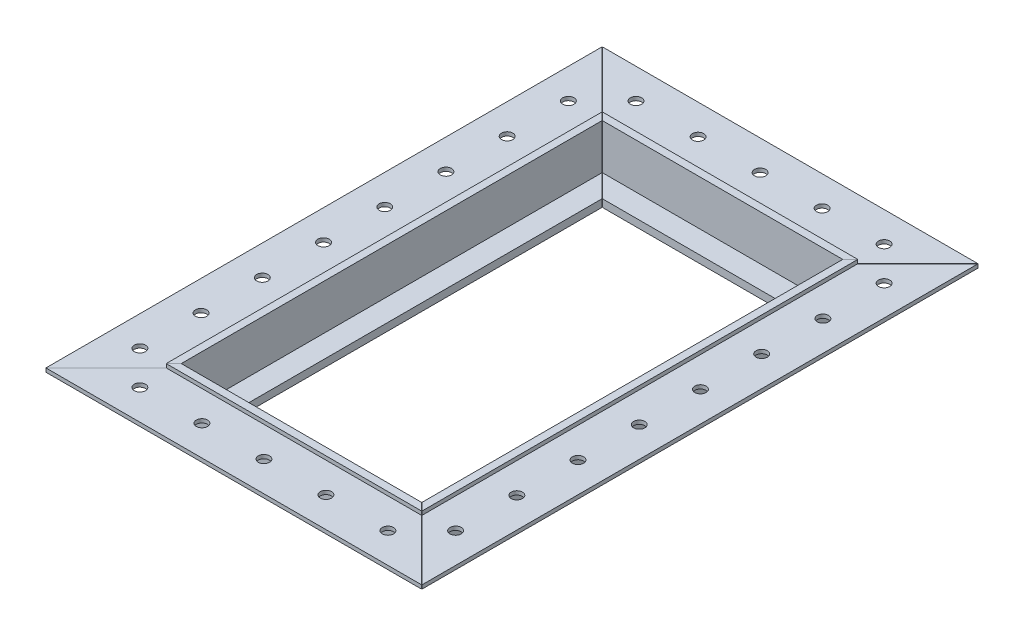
ISO-10303-21;
HEADER;
FILE_DESCRIPTION(('STEP AP214'),'2;1');
FILE_NAME('part.step','',(''),(''),'','','');
FILE_SCHEMA(('AUTOMOTIVE_DESIGN { 1 0 10303 214 1 1 1 1 }'));
ENDSEC;
DATA;
#1=APPLICATION_CONTEXT('core data for automotive mechanical design processes');
#2=APPLICATION_PROTOCOL_DEFINITION('international standard','automotive_design',2000,#1);
#3=PRODUCT_CONTEXT('',#1,'mechanical');
#4=PRODUCT('Part','Part','',(#3));
#5=PRODUCT_RELATED_PRODUCT_CATEGORY('part','',(#4));
#6=PRODUCT_DEFINITION_FORMATION('','',#4);
#7=PRODUCT_DEFINITION_CONTEXT('part definition',#1,'design');
#8=PRODUCT_DEFINITION('design','',#6,#7);
#9=PRODUCT_DEFINITION_SHAPE('','',#8);
#10=(LENGTH_UNIT() NAMED_UNIT(*) SI_UNIT(.MILLI.,.METRE.));
#11=(NAMED_UNIT(*) PLANE_ANGLE_UNIT() SI_UNIT($,.RADIAN.));
#12=(NAMED_UNIT(*) SI_UNIT($,.STERADIAN.) SOLID_ANGLE_UNIT());
#13=UNCERTAINTY_MEASURE_WITH_UNIT(LENGTH_MEASURE(1.E-05),#10,'distance_accuracy_value','');
#14=(GEOMETRIC_REPRESENTATION_CONTEXT(3) GLOBAL_UNCERTAINTY_ASSIGNED_CONTEXT((#13)) GLOBAL_UNIT_ASSIGNED_CONTEXT((#10,
#11,#12)) REPRESENTATION_CONTEXT('',''));
#15=CARTESIAN_POINT('',(0.,0.,0.));
#16=DIRECTION('',(0.,0.,1.));
#17=DIRECTION('',(1.,0.,0.));
#18=AXIS2_PLACEMENT_3D('',#15,#16,#17);
#19=CARTESIAN_POINT('',(0.,22.2250000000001,88.9));
#20=DIRECTION('',(0.,-1.,0.));
#21=DIRECTION('',(1.,0.,0.));
#22=AXIS2_PLACEMENT_3D('',#19,#20,#21);
#23=PLANE('',#22);
#24=DIRECTION('',(0.,0.,-1.));
#25=VECTOR('',#24,1.);
#26=CARTESIAN_POINT('',(92.075,22.225,88.9));
#27=LINE('',#26,#25);
#28=CARTESIAN_POINT('',(92.075,22.225,88.8640789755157));
#29=VERTEX_POINT('',#28);
#30=CARTESIAN_POINT('',(92.075,22.225,-88.8640789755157));
#31=VERTEX_POINT('',#30);
#32=EDGE_CURVE('E162',#29,#31,#27,.T.);
#33=ORIENTED_EDGE('',*,*,#32,.F.);
#34=DIRECTION('',(-0.707106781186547,0.,-0.707106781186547));
#35=VECTOR('',#34,1.);
#36=CARTESIAN_POINT('',(120.667960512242,22.225,117.457039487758));
#37=LINE('',#36,#35);
#38=CARTESIAN_POINT('',(95.25,22.225,92.0390789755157));
#39=VERTEX_POINT('',#38);
#40=EDGE_CURVE('E14',#39,#29,#37,.T.);
#41=ORIENTED_EDGE('',*,*,#40,.F.);
#42=DIRECTION('',(0.,0.,-1.));
#43=VECTOR('',#42,1.);
#44=CARTESIAN_POINT('',(95.25,22.225,88.9));
#45=LINE('',#44,#43);
#46=CARTESIAN_POINT('',(95.25,22.225,-92.0390789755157));
#47=VERTEX_POINT('',#46);
#48=EDGE_CURVE('E114',#39,#47,#45,.T.);
#49=ORIENTED_EDGE('',*,*,#48,.T.);
#50=DIRECTION('',(0.707106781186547,0.,-0.707106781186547));
#51=VECTOR('',#50,1.);
#52=CARTESIAN_POINT('',(120.667960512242,22.225,-117.457039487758));
#53=LINE('',#52,#51);
#54=EDGE_CURVE('E70',#31,#47,#53,.T.);
#55=ORIENTED_EDGE('',*,*,#54,.F.);
#56=EDGE_LOOP('',(#33,#41,#49,#55));
#57=FACE_BOUND('',#56,.T.);
#58=ADVANCED_FACE('F61',(#57),#23,.F.);
#59=CARTESIAN_POINT('',(82.55,0.,88.9));
#60=DIRECTION('',(1.,0.,0.));
#61=DIRECTION('',(0.,0.,-1.));
#62=AXIS2_PLACEMENT_3D('',#59,#60,#61);
#63=PLANE('',#62);
#64=DIRECTION('',(0.,0.,-1.));
#65=VECTOR('',#64,1.);
#66=CARTESIAN_POINT('',(82.55,0.,88.9));
#67=LINE('',#66,#65);
#68=CARTESIAN_POINT('',(82.55,-1.3118473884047E-13,79.3390789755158));
#69=VERTEX_POINT('',#68);
#70=CARTESIAN_POINT('',(82.55,-1.3118473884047E-13,-79.3390789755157));
#71=VERTEX_POINT('',#70);
#72=EDGE_CURVE('E121',#69,#71,#67,.T.);
#73=ORIENTED_EDGE('',*,*,#72,.F.);
#74=DIRECTION('',(0.,1.,0.));
#75=VECTOR('',#74,1.);
#76=CARTESIAN_POINT('',(82.55,0.,79.3390789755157));
#77=LINE('',#76,#75);
#78=CARTESIAN_POINT('',(82.55,3.17500000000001,79.3390789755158));
#79=VERTEX_POINT('',#78);
#80=EDGE_CURVE('E104',#69,#79,#77,.T.);
#81=ORIENTED_EDGE('',*,*,#80,.T.);
#82=DIRECTION('',(0.,0.,-1.));
#83=VECTOR('',#82,1.);
#84=CARTESIAN_POINT('',(82.55,3.17500000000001,88.9));
#85=LINE('',#84,#83);
#86=CARTESIAN_POINT('',(82.55,3.17500000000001,-79.3390789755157));
#87=VERTEX_POINT('',#86);
#88=EDGE_CURVE('E113',#79,#87,#85,.T.);
#89=ORIENTED_EDGE('',*,*,#88,.T.);
#90=DIRECTION('',(0.,-1.,0.));
#91=VECTOR('',#90,1.);
#92=CARTESIAN_POINT('',(82.55,1.83841436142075E-13,-79.3390789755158));
#93=LINE('',#92,#91);
#94=EDGE_CURVE('E129',#87,#71,#93,.T.);
#95=ORIENTED_EDGE('',*,*,#94,.T.);
#96=EDGE_LOOP('',(#73,#81,#89,#95));
#97=FACE_BOUND('',#96,.T.);
#98=ADVANCED_FACE('F127',(#97),#63,.F.);
#99=CARTESIAN_POINT('',(95.25,0.,88.9));
#100=DIRECTION('',(-1.,0.,0.));
#101=DIRECTION('',(0.,0.,1.));
#102=AXIS2_PLACEMENT_3D('',#99,#100,#101);
#103=PLANE('',#102);
#104=DIRECTION('',(0.,0.,-1.));
#105=VECTOR('',#104,1.);
#106=CARTESIAN_POINT('',(95.25,19.05,88.9));
#107=LINE('',#106,#105);
#108=CARTESIAN_POINT('',(95.25,19.05,92.0390789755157));
#109=VERTEX_POINT('',#108);
#110=CARTESIAN_POINT('',(95.25,19.05,-92.0390789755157));
#111=VERTEX_POINT('',#110);
#112=EDGE_CURVE('E140',#109,#111,#107,.T.);
#113=ORIENTED_EDGE('',*,*,#112,.F.);
#114=DIRECTION('',(0.,-1.,0.));
#115=VECTOR('',#114,1.);
#116=CARTESIAN_POINT('',(95.25,0.,92.0390789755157));
#117=LINE('',#116,#115);
#118=CARTESIAN_POINT('',(95.25,-1.45273966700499E-13,92.0390789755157));
#119=VERTEX_POINT('',#118);
#120=EDGE_CURVE('E77',#109,#119,#117,.T.);
#121=ORIENTED_EDGE('',*,*,#120,.T.);
#122=DIRECTION('',(0.,0.,-1.));
#123=VECTOR('',#122,1.);
#124=CARTESIAN_POINT('',(95.25,0.,88.9));
#125=LINE('',#124,#123);
#126=CARTESIAN_POINT('',(95.25,-1.45273966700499E-13,-92.0390789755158));
#127=VERTEX_POINT('',#126);
#128=EDGE_CURVE('E124',#119,#127,#125,.T.);
#129=ORIENTED_EDGE('',*,*,#128,.T.);
#130=DIRECTION('',(0.,1.,0.));
#131=VECTOR('',#130,1.);
#132=CARTESIAN_POINT('',(95.25,1.97719223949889E-13,-92.0390789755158));
#133=LINE('',#132,#131);
#134=EDGE_CURVE('E139',#127,#111,#133,.T.);
#135=ORIENTED_EDGE('',*,*,#134,.T.);
#136=EDGE_LOOP('',(#113,#121,#129,#135));
#137=FACE_BOUND('',#136,.T.);
#138=ADVANCED_FACE('F242',(#137),#103,.F.);
#139=CARTESIAN_POINT('',(0.,3.17499999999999,88.9));
#140=DIRECTION('',(0.,-1.,0.));
#141=DIRECTION('',(1.,0.,0.));
#142=AXIS2_PLACEMENT_3D('',#139,#140,#141);
#143=PLANE('',#142);
#144=ORIENTED_EDGE('',*,*,#88,.F.);
#145=DIRECTION('',(0.707106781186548,0.,0.707106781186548));
#146=VECTOR('',#145,1.);
#147=CARTESIAN_POINT('',(46.0554605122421,3.175,42.8445394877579));
#148=LINE('',#147,#146);
#149=CARTESIAN_POINT('',(92.075,3.17500000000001,88.8640789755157));
#150=VERTEX_POINT('',#149);
#151=EDGE_CURVE('E108',#79,#150,#148,.T.);
#152=ORIENTED_EDGE('',*,*,#151,.T.);
#153=DIRECTION('',(0.,0.,-1.));
#154=VECTOR('',#153,1.);
#155=CARTESIAN_POINT('',(92.075,3.17500000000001,88.9));
#156=LINE('',#155,#154);
#157=CARTESIAN_POINT('',(92.075,3.17500000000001,-88.8640789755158));
#158=VERTEX_POINT('',#157);
#159=EDGE_CURVE('E166',#150,#158,#156,.T.);
#160=ORIENTED_EDGE('',*,*,#159,.T.);
#161=DIRECTION('',(-0.707106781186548,0.,0.707106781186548));
#162=VECTOR('',#161,1.);
#163=CARTESIAN_POINT('',(-42.8445394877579,3.17499999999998,46.0554605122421));
#164=LINE('',#163,#162);
#165=EDGE_CURVE('E125',#158,#87,#164,.T.);
#166=ORIENTED_EDGE('',*,*,#165,.T.);
#167=EDGE_LOOP('',(#144,#152,#160,#166));
#168=FACE_BOUND('',#167,.T.);
#169=ADVANCED_FACE('F195',(#168),#143,.F.);
#170=CARTESIAN_POINT('',(0.,0.,88.9));
#171=DIRECTION('',(0.,1.,0.));
#172=DIRECTION('',(-1.,0.,0.));
#173=AXIS2_PLACEMENT_3D('',#170,#171,#172);
#174=PLANE('',#173);
#175=ORIENTED_EDGE('',*,*,#128,.F.);
#176=DIRECTION('',(-0.707106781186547,0.,-0.707106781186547));
#177=VECTOR('',#176,1.);
#178=CARTESIAN_POINT('',(120.667960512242,-1.73472347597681E-13,117.457039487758));
#179=LINE('',#178,#177);
#180=EDGE_CURVE('E64',#119,#69,#179,.T.);
#181=ORIENTED_EDGE('',*,*,#180,.T.);
#182=ORIENTED_EDGE('',*,*,#72,.T.);
#183=DIRECTION('',(0.707106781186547,0.,-0.707106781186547));
#184=VECTOR('',#183,1.);
#185=CARTESIAN_POINT('',(120.667960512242,-1.73472347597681E-13,-117.457039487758));
#186=LINE('',#185,#184);
#187=EDGE_CURVE('E130',#71,#127,#186,.T.);
#188=ORIENTED_EDGE('',*,*,#187,.T.);
#189=EDGE_LOOP('',(#175,#181,#182,#188));
#190=FACE_BOUND('',#189,.T.);
#191=ADVANCED_FACE('F119',(#190),#174,.F.);
#192=CARTESIAN_POINT('',(0.,19.05,88.9));
#193=DIRECTION('',(0.,1.,0.));
#194=DIRECTION('',(-1.,0.,0.));
#195=AXIS2_PLACEMENT_3D('',#192,#193,#194);
#196=PLANE('',#195);
#197=CARTESIAN_POINT('',(107.95,19.05,-90.4875));
#198=DIRECTION('',(0.,1.,0.));
#199=DIRECTION('',(-1.,0.,0.));
#200=AXIS2_PLACEMENT_3D('',#197,#198,#199);
#201=CIRCLE('',#200,2.38125);
#202=CARTESIAN_POINT('',(105.56875,19.05,-90.4875));
#203=VERTEX_POINT('',#202);
#204=EDGE_CURVE('E161',#203,#203,#201,.T.);
#205=ORIENTED_EDGE('',*,*,#204,.T.);
#206=EDGE_LOOP('',(#205));
#207=FACE_BOUND('',#206,.T.);
#208=CARTESIAN_POINT('',(107.95,19.05,-64.63392857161));
#209=DIRECTION('',(0.,1.,0.));
#210=DIRECTION('',(-1.,0.,0.));
#211=AXIS2_PLACEMENT_3D('',#208,#209,#210);
#212=CIRCLE('',#211,2.38125);
#213=CARTESIAN_POINT('',(105.56875,19.05,-64.63392857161));
#214=VERTEX_POINT('',#213);
#215=EDGE_CURVE('E248',#214,#214,#212,.T.);
#216=ORIENTED_EDGE('',*,*,#215,.T.);
#217=EDGE_LOOP('',(#216));
#218=FACE_BOUND('',#217,.T.);
#219=CARTESIAN_POINT('',(107.95,19.05,-38.7803571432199));
#220=DIRECTION('',(0.,1.,0.));
#221=DIRECTION('',(-1.,0.,0.));
#222=AXIS2_PLACEMENT_3D('',#219,#220,#221);
#223=CIRCLE('',#222,2.38125);
#224=CARTESIAN_POINT('',(105.56875,19.05,-38.7803571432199));
#225=VERTEX_POINT('',#224);
#226=EDGE_CURVE('E251',#225,#225,#223,.T.);
#227=ORIENTED_EDGE('',*,*,#226,.T.);
#228=EDGE_LOOP('',(#227));
#229=FACE_BOUND('',#228,.T.);
#230=CARTESIAN_POINT('',(107.95,19.05,-12.9267857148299));
#231=DIRECTION('',(0.,1.,0.));
#232=DIRECTION('',(-1.,0.,0.));
#233=AXIS2_PLACEMENT_3D('',#230,#231,#232);
#234=CIRCLE('',#233,2.38125000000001);
#235=CARTESIAN_POINT('',(105.56875,19.05,-12.9267857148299));
#236=VERTEX_POINT('',#235);
#237=EDGE_CURVE('E254',#236,#236,#234,.T.);
#238=ORIENTED_EDGE('',*,*,#237,.T.);
#239=EDGE_LOOP('',(#238));
#240=FACE_BOUND('',#239,.T.);
#241=CARTESIAN_POINT('',(107.95,19.05,12.92678571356));
#242=DIRECTION('',(0.,1.,0.));
#243=DIRECTION('',(-1.,0.,0.));
#244=AXIS2_PLACEMENT_3D('',#241,#242,#243);
#245=CIRCLE('',#244,2.38125000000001);
#246=CARTESIAN_POINT('',(105.56875,19.05,12.92678571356));
#247=VERTEX_POINT('',#246);
#248=EDGE_CURVE('E257',#247,#247,#245,.T.);
#249=ORIENTED_EDGE('',*,*,#248,.T.);
#250=EDGE_LOOP('',(#249));
#251=FACE_BOUND('',#250,.T.);
#252=CARTESIAN_POINT('',(107.95,19.05,38.78035714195));
#253=DIRECTION('',(0.,1.,0.));
#254=DIRECTION('',(-1.,0.,0.));
#255=AXIS2_PLACEMENT_3D('',#252,#253,#254);
#256=CIRCLE('',#255,2.38125);
#257=CARTESIAN_POINT('',(105.56875,19.05,38.78035714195));
#258=VERTEX_POINT('',#257);
#259=EDGE_CURVE('E260',#258,#258,#256,.T.);
#260=ORIENTED_EDGE('',*,*,#259,.T.);
#261=EDGE_LOOP('',(#260));
#262=FACE_BOUND('',#261,.T.);
#263=CARTESIAN_POINT('',(107.95,19.05,64.63392857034));
#264=DIRECTION('',(0.,1.,0.));
#265=DIRECTION('',(-1.,0.,0.));
#266=AXIS2_PLACEMENT_3D('',#263,#264,#265);
#267=CIRCLE('',#266,2.38125);
#268=CARTESIAN_POINT('',(105.56875,19.05,64.63392857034));
#269=VERTEX_POINT('',#268);
#270=EDGE_CURVE('E263',#269,#269,#267,.T.);
#271=ORIENTED_EDGE('',*,*,#270,.T.);
#272=EDGE_LOOP('',(#271));
#273=FACE_BOUND('',#272,.T.);
#274=CARTESIAN_POINT('',(107.95,19.05,90.48749999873));
#275=DIRECTION('',(0.,1.,0.));
#276=DIRECTION('',(-1.,0.,0.));
#277=AXIS2_PLACEMENT_3D('',#274,#275,#276);
#278=CIRCLE('',#277,2.38125);
#279=CARTESIAN_POINT('',(105.56875,19.05,90.48749999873));
#280=VERTEX_POINT('',#279);
#281=EDGE_CURVE('E266',#280,#280,#278,.T.);
#282=ORIENTED_EDGE('',*,*,#281,.T.);
#283=EDGE_LOOP('',(#282));
#284=FACE_BOUND('',#283,.T.);
#285=DIRECTION('',(0.,0.,-1.));
#286=VECTOR('',#285,1.);
#287=CARTESIAN_POINT('',(120.65,19.05,88.9));
#288=LINE('',#287,#286);
#289=CARTESIAN_POINT('',(120.65,19.05,117.439078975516));
#290=VERTEX_POINT('',#289);
#291=CARTESIAN_POINT('',(120.65,19.05,-117.439078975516));
#292=VERTEX_POINT('',#291);
#293=EDGE_CURVE('E144',#290,#292,#288,.T.);
#294=ORIENTED_EDGE('',*,*,#293,.F.);
#295=DIRECTION('',(-0.707106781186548,0.,-0.707106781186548));
#296=VECTOR('',#295,1.);
#297=CARTESIAN_POINT('',(46.0554605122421,19.05,42.8445394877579));
#298=LINE('',#297,#296);
#299=EDGE_CURVE('E132',#290,#109,#298,.T.);
#300=ORIENTED_EDGE('',*,*,#299,.T.);
#301=ORIENTED_EDGE('',*,*,#112,.T.);
#302=DIRECTION('',(0.707106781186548,0.,-0.707106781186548));
#303=VECTOR('',#302,1.);
#304=CARTESIAN_POINT('',(-42.8445394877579,19.05,46.0554605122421));
#305=LINE('',#304,#303);
#306=EDGE_CURVE('E143',#111,#292,#305,.T.);
#307=ORIENTED_EDGE('',*,*,#306,.T.);
#308=EDGE_LOOP('',(#294,#300,#301,#307));
#309=FACE_BOUND('',#308,.T.);
#310=ADVANCED_FACE('F238',(#207,#218,#229,#240,#251,#262,#273,#284,#309),#196,.F.);
#311=CARTESIAN_POINT('',(120.65,0.,88.9));
#312=DIRECTION('',(-1.,0.,0.));
#313=DIRECTION('',(0.,0.,1.));
#314=AXIS2_PLACEMENT_3D('',#311,#312,#313);
#315=PLANE('',#314);
#316=DIRECTION('',(0.,0.,-1.));
#317=VECTOR('',#316,1.);
#318=CARTESIAN_POINT('',(120.65,20.6375,88.9));
#319=LINE('',#318,#317);
#320=CARTESIAN_POINT('',(120.65,20.6375,117.439078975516));
#321=VERTEX_POINT('',#320);
#322=CARTESIAN_POINT('',(120.65,20.6375,-117.439078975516));
#323=VERTEX_POINT('',#322);
#324=EDGE_CURVE('E149',#321,#323,#319,.T.);
#325=ORIENTED_EDGE('',*,*,#324,.F.);
#326=DIRECTION('',(0.,-1.,0.));
#327=VECTOR('',#326,1.);
#328=CARTESIAN_POINT('',(120.65,0.,117.439078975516));
#329=LINE('',#328,#327);
#330=EDGE_CURVE('E148',#321,#290,#329,.T.);
#331=ORIENTED_EDGE('',*,*,#330,.T.);
#332=ORIENTED_EDGE('',*,*,#293,.T.);
#333=DIRECTION('',(0.,1.,0.));
#334=VECTOR('',#333,1.);
#335=CARTESIAN_POINT('',(120.65,2.25474799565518E-13,-117.439078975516));
#336=LINE('',#335,#334);
#337=EDGE_CURVE('E147',#292,#323,#336,.T.);
#338=ORIENTED_EDGE('',*,*,#337,.T.);
#339=EDGE_LOOP('',(#325,#331,#332,#338));
#340=FACE_BOUND('',#339,.T.);
#341=ADVANCED_FACE('F231',(#340),#315,.F.);
#342=CARTESIAN_POINT('',(0.,20.6375,88.9));
#343=DIRECTION('',(0.,-1.,0.));
#344=DIRECTION('',(1.,0.,0.));
#345=AXIS2_PLACEMENT_3D('',#342,#343,#344);
#346=PLANE('',#345);
#347=CARTESIAN_POINT('',(107.95,20.6375,-90.4875));
#348=DIRECTION('',(0.,1.,0.));
#349=DIRECTION('',(1.,0.,0.));
#350=AXIS2_PLACEMENT_3D('',#347,#348,#349);
#351=CIRCLE('',#350,2.38125);
#352=CARTESIAN_POINT('',(110.33125,20.6375,-90.4875));
#353=VERTEX_POINT('',#352);
#354=EDGE_CURVE('E269',#353,#353,#351,.T.);
#355=ORIENTED_EDGE('',*,*,#354,.F.);
#356=EDGE_LOOP('',(#355));
#357=FACE_BOUND('',#356,.T.);
#358=CARTESIAN_POINT('',(107.95,20.6375,-64.63392857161));
#359=DIRECTION('',(0.,1.,0.));
#360=DIRECTION('',(1.,0.,0.));
#361=AXIS2_PLACEMENT_3D('',#358,#359,#360);
#362=CIRCLE('',#361,2.38125);
#363=CARTESIAN_POINT('',(110.33125,20.6375,-64.63392857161));
#364=VERTEX_POINT('',#363);
#365=EDGE_CURVE('E288',#364,#364,#362,.T.);
#366=ORIENTED_EDGE('',*,*,#365,.F.);
#367=EDGE_LOOP('',(#366));
#368=FACE_BOUND('',#367,.T.);
#369=CARTESIAN_POINT('',(107.95,20.6375,-38.7803571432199));
#370=DIRECTION('',(0.,1.,0.));
#371=DIRECTION('',(1.,0.,0.));
#372=AXIS2_PLACEMENT_3D('',#369,#370,#371);
#373=CIRCLE('',#372,2.38125);
#374=CARTESIAN_POINT('',(110.33125,20.6375,-38.7803571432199));
#375=VERTEX_POINT('',#374);
#376=EDGE_CURVE('E285',#375,#375,#373,.T.);
#377=ORIENTED_EDGE('',*,*,#376,.F.);
#378=EDGE_LOOP('',(#377));
#379=FACE_BOUND('',#378,.T.);
#380=CARTESIAN_POINT('',(107.95,20.6375,-12.9267857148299));
#381=DIRECTION('',(0.,1.,0.));
#382=DIRECTION('',(1.,0.,0.));
#383=AXIS2_PLACEMENT_3D('',#380,#381,#382);
#384=CIRCLE('',#383,2.38125000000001);
#385=CARTESIAN_POINT('',(110.33125,20.6375,-12.9267857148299));
#386=VERTEX_POINT('',#385);
#387=EDGE_CURVE('E282',#386,#386,#384,.T.);
#388=ORIENTED_EDGE('',*,*,#387,.F.);
#389=EDGE_LOOP('',(#388));
#390=FACE_BOUND('',#389,.T.);
#391=CARTESIAN_POINT('',(107.95,20.6375,12.92678571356));
#392=DIRECTION('',(0.,1.,0.));
#393=DIRECTION('',(1.,0.,0.));
#394=AXIS2_PLACEMENT_3D('',#391,#392,#393);
#395=CIRCLE('',#394,2.38125000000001);
#396=CARTESIAN_POINT('',(110.33125,20.6375,12.92678571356));
#397=VERTEX_POINT('',#396);
#398=EDGE_CURVE('E279',#397,#397,#395,.T.);
#399=ORIENTED_EDGE('',*,*,#398,.F.);
#400=EDGE_LOOP('',(#399));
#401=FACE_BOUND('',#400,.T.);
#402=CARTESIAN_POINT('',(107.95,20.6375,38.78035714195));
#403=DIRECTION('',(0.,1.,0.));
#404=DIRECTION('',(1.,0.,0.));
#405=AXIS2_PLACEMENT_3D('',#402,#403,#404);
#406=CIRCLE('',#405,2.38125);
#407=CARTESIAN_POINT('',(110.33125,20.6375,38.78035714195));
#408=VERTEX_POINT('',#407);
#409=EDGE_CURVE('E276',#408,#408,#406,.T.);
#410=ORIENTED_EDGE('',*,*,#409,.F.);
#411=EDGE_LOOP('',(#410));
#412=FACE_BOUND('',#411,.T.);
#413=CARTESIAN_POINT('',(107.95,20.6375,64.63392857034));
#414=DIRECTION('',(0.,1.,0.));
#415=DIRECTION('',(1.,0.,0.));
#416=AXIS2_PLACEMENT_3D('',#413,#414,#415);
#417=CIRCLE('',#416,2.38125);
#418=CARTESIAN_POINT('',(110.33125,20.6375,64.63392857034));
#419=VERTEX_POINT('',#418);
#420=EDGE_CURVE('E273',#419,#419,#417,.T.);
#421=ORIENTED_EDGE('',*,*,#420,.F.);
#422=EDGE_LOOP('',(#421));
#423=FACE_BOUND('',#422,.T.);
#424=CARTESIAN_POINT('',(107.95,20.6375,90.48749999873));
#425=DIRECTION('',(0.,1.,0.));
#426=DIRECTION('',(1.,0.,0.));
#427=AXIS2_PLACEMENT_3D('',#424,#425,#426);
#428=CIRCLE('',#427,2.38125);
#429=CARTESIAN_POINT('',(110.33125,20.6375,90.48749999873));
#430=VERTEX_POINT('',#429);
#431=EDGE_CURVE('E270',#430,#430,#428,.T.);
#432=ORIENTED_EDGE('',*,*,#431,.F.);
#433=EDGE_LOOP('',(#432));
#434=FACE_BOUND('',#433,.T.);
#435=DIRECTION('',(0.,0.,-1.));
#436=VECTOR('',#435,1.);
#437=CARTESIAN_POINT('',(95.25,20.6375,88.9));
#438=LINE('',#437,#436);
#439=CARTESIAN_POINT('',(95.25,20.6375,92.0390789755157));
#440=VERTEX_POINT('',#439);
#441=CARTESIAN_POINT('',(95.25,20.6375,-92.0390789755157));
#442=VERTEX_POINT('',#441);
#443=EDGE_CURVE('E154',#440,#442,#438,.T.);
#444=ORIENTED_EDGE('',*,*,#443,.F.);
#445=DIRECTION('',(0.707106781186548,0.,0.707106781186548));
#446=VECTOR('',#445,1.);
#447=CARTESIAN_POINT('',(46.0554605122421,20.6375,42.8445394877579));
#448=LINE('',#447,#446);
#449=EDGE_CURVE('E153',#440,#321,#448,.T.);
#450=ORIENTED_EDGE('',*,*,#449,.T.);
#451=ORIENTED_EDGE('',*,*,#324,.T.);
#452=DIRECTION('',(-0.707106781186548,0.,0.707106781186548));
#453=VECTOR('',#452,1.);
#454=CARTESIAN_POINT('',(-42.8445394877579,20.6375,46.0554605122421));
#455=LINE('',#454,#453);
#456=EDGE_CURVE('E152',#323,#442,#455,.T.);
#457=ORIENTED_EDGE('',*,*,#456,.T.);
#458=EDGE_LOOP('',(#444,#450,#451,#457));
#459=FACE_BOUND('',#458,.T.);
#460=ADVANCED_FACE('F226',(#357,#368,#379,#390,#401,#412,#423,#434,#459),#346,.F.);
#461=CARTESIAN_POINT('',(95.25,0.,88.9));
#462=DIRECTION('',(-1.,0.,0.));
#463=DIRECTION('',(0.,0.,1.));
#464=AXIS2_PLACEMENT_3D('',#461,#462,#463);
#465=PLANE('',#464);
#466=ORIENTED_EDGE('',*,*,#48,.F.);
#467=DIRECTION('',(0.,-1.,0.));
#468=VECTOR('',#467,1.);
#469=CARTESIAN_POINT('',(95.25,0.,92.0390789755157));
#470=LINE('',#469,#468);
#471=EDGE_CURVE('E158',#39,#440,#470,.T.);
#472=ORIENTED_EDGE('',*,*,#471,.T.);
#473=ORIENTED_EDGE('',*,*,#443,.T.);
#474=DIRECTION('',(0.,1.,0.));
#475=VECTOR('',#474,1.);
#476=CARTESIAN_POINT('',(95.25,1.97719223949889E-13,-92.0390789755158));
#477=LINE('',#476,#475);
#478=EDGE_CURVE('E157',#442,#47,#477,.T.);
#479=ORIENTED_EDGE('',*,*,#478,.T.);
#480=EDGE_LOOP('',(#466,#472,#473,#479));
#481=FACE_BOUND('',#480,.T.);
#482=ADVANCED_FACE('F219',(#481),#465,.F.);
#483=CARTESIAN_POINT('',(92.075,0.,88.9));
#484=DIRECTION('',(1.,0.,0.));
#485=DIRECTION('',(0.,0.,-1.));
#486=AXIS2_PLACEMENT_3D('',#483,#484,#485);
#487=PLANE('',#486);
#488=ORIENTED_EDGE('',*,*,#159,.F.);
#489=DIRECTION('',(0.,1.,0.));
#490=VECTOR('',#489,1.);
#491=CARTESIAN_POINT('',(92.075,0.,88.8640789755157));
#492=LINE('',#491,#490);
#493=EDGE_CURVE('E165',#150,#29,#492,.T.);
#494=ORIENTED_EDGE('',*,*,#493,.T.);
#495=ORIENTED_EDGE('',*,*,#32,.T.);
#496=DIRECTION('',(0.,-1.,0.));
#497=VECTOR('',#496,1.);
#498=CARTESIAN_POINT('',(92.075,1.94249776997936E-13,-88.8640789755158));
#499=LINE('',#498,#497);
#500=EDGE_CURVE('E136',#31,#158,#499,.T.);
#501=ORIENTED_EDGE('',*,*,#500,.T.);
#502=EDGE_LOOP('',(#488,#494,#495,#501));
#503=FACE_BOUND('',#502,.T.);
#504=ADVANCED_FACE('F201',(#503),#487,.F.);
#505=CARTESIAN_POINT('',(120.667960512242,-1.73472347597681E-13,-117.457039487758));
#506=DIRECTION('',(0.707106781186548,0.,0.707106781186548));
#507=DIRECTION('',(0.707106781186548,0.,-0.707106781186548));
#508=AXIS2_PLACEMENT_3D('',#505,#506,#507);
#509=PLANE('',#508);
#510=ORIENTED_EDGE('',*,*,#187,.F.);
#511=ORIENTED_EDGE('',*,*,#94,.F.);
#512=ORIENTED_EDGE('',*,*,#165,.F.);
#513=ORIENTED_EDGE('',*,*,#500,.F.);
#514=ORIENTED_EDGE('',*,*,#54,.T.);
#515=ORIENTED_EDGE('',*,*,#478,.F.);
#516=ORIENTED_EDGE('',*,*,#456,.F.);
#517=ORIENTED_EDGE('',*,*,#337,.F.);
#518=ORIENTED_EDGE('',*,*,#306,.F.);
#519=ORIENTED_EDGE('',*,*,#134,.F.);
#520=EDGE_LOOP('',(#510,#511,#512,#513,#514,#515,#516,#517,#518,#519));
#521=FACE_BOUND('',#520,.T.);
#522=ADVANCED_FACE('F208',(#521),#509,.F.);
#523=CARTESIAN_POINT('',(120.667960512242,-1.73472347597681E-13,117.457039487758));
#524=DIRECTION('',(0.707106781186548,0.,-0.707106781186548));
#525=DIRECTION('',(-0.707106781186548,0.,-0.707106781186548));
#526=AXIS2_PLACEMENT_3D('',#523,#524,#525);
#527=PLANE('',#526);
#528=ORIENTED_EDGE('',*,*,#299,.F.);
#529=ORIENTED_EDGE('',*,*,#330,.F.);
#530=ORIENTED_EDGE('',*,*,#449,.F.);
#531=ORIENTED_EDGE('',*,*,#471,.F.);
#532=ORIENTED_EDGE('',*,*,#40,.T.);
#533=ORIENTED_EDGE('',*,*,#493,.F.);
#534=ORIENTED_EDGE('',*,*,#151,.F.);
#535=ORIENTED_EDGE('',*,*,#80,.F.);
#536=ORIENTED_EDGE('',*,*,#180,.F.);
#537=ORIENTED_EDGE('',*,*,#120,.F.);
#538=EDGE_LOOP('',(#528,#529,#530,#531,#532,#533,#534,#535,#536,#537));
#539=FACE_BOUND('',#538,.T.);
#540=ADVANCED_FACE('F106',(#539),#527,.F.);
#541=CARTESIAN_POINT('',(107.95,18.0975,90.48749999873));
#542=DIRECTION('',(0.,1.,0.));
#543=DIRECTION('',(-1.,0.,0.));
#544=AXIS2_PLACEMENT_3D('',#541,#542,#543);
#545=CYLINDRICAL_SURFACE('',#544,2.38125);
#546=ORIENTED_EDGE('',*,*,#431,.T.);
#547=EDGE_LOOP('',(#546));
#548=FACE_BOUND('',#547,.T.);
#549=ORIENTED_EDGE('',*,*,#281,.F.);
#550=EDGE_LOOP('',(#549));
#551=FACE_BOUND('',#550,.T.);
#552=ADVANCED_FACE('F314',(#548,#551),#545,.F.);
#553=CARTESIAN_POINT('',(107.95,18.0975,64.63392857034));
#554=DIRECTION('',(0.,1.,0.));
#555=DIRECTION('',(-1.,0.,0.));
#556=AXIS2_PLACEMENT_3D('',#553,#554,#555);
#557=CYLINDRICAL_SURFACE('',#556,2.38125);
#558=ORIENTED_EDGE('',*,*,#420,.T.);
#559=EDGE_LOOP('',(#558));
#560=FACE_BOUND('',#559,.T.);
#561=ORIENTED_EDGE('',*,*,#270,.F.);
#562=EDGE_LOOP('',(#561));
#563=FACE_BOUND('',#562,.T.);
#564=ADVANCED_FACE('F317',(#560,#563),#557,.F.);
#565=CARTESIAN_POINT('',(107.95,18.0975,38.78035714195));
#566=DIRECTION('',(0.,1.,0.));
#567=DIRECTION('',(-1.,0.,0.));
#568=AXIS2_PLACEMENT_3D('',#565,#566,#567);
#569=CYLINDRICAL_SURFACE('',#568,2.38125);
#570=ORIENTED_EDGE('',*,*,#409,.T.);
#571=EDGE_LOOP('',(#570));
#572=FACE_BOUND('',#571,.T.);
#573=ORIENTED_EDGE('',*,*,#259,.F.);
#574=EDGE_LOOP('',(#573));
#575=FACE_BOUND('',#574,.T.);
#576=ADVANCED_FACE('F363',(#572,#575),#569,.F.);
#577=CARTESIAN_POINT('',(107.95,18.0975,12.92678571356));
#578=DIRECTION('',(0.,1.,0.));
#579=DIRECTION('',(-1.,0.,0.));
#580=AXIS2_PLACEMENT_3D('',#577,#578,#579);
#581=CYLINDRICAL_SURFACE('',#580,2.38125000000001);
#582=ORIENTED_EDGE('',*,*,#398,.T.);
#583=EDGE_LOOP('',(#582));
#584=FACE_BOUND('',#583,.T.);
#585=ORIENTED_EDGE('',*,*,#248,.F.);
#586=EDGE_LOOP('',(#585));
#587=FACE_BOUND('',#586,.T.);
#588=ADVANCED_FACE('F370',(#584,#587),#581,.F.);
#589=CARTESIAN_POINT('',(107.95,18.0975,-12.9267857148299));
#590=DIRECTION('',(0.,1.,0.));
#591=DIRECTION('',(-1.,0.,0.));
#592=AXIS2_PLACEMENT_3D('',#589,#590,#591);
#593=CYLINDRICAL_SURFACE('',#592,2.38125000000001);
#594=ORIENTED_EDGE('',*,*,#387,.T.);
#595=EDGE_LOOP('',(#594));
#596=FACE_BOUND('',#595,.T.);
#597=ORIENTED_EDGE('',*,*,#237,.F.);
#598=EDGE_LOOP('',(#597));
#599=FACE_BOUND('',#598,.T.);
#600=ADVANCED_FACE('F378',(#596,#599),#593,.F.);
#601=CARTESIAN_POINT('',(107.95,18.0975,-38.7803571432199));
#602=DIRECTION('',(0.,1.,0.));
#603=DIRECTION('',(-1.,0.,0.));
#604=AXIS2_PLACEMENT_3D('',#601,#602,#603);
#605=CYLINDRICAL_SURFACE('',#604,2.38125);
#606=ORIENTED_EDGE('',*,*,#376,.T.);
#607=EDGE_LOOP('',(#606));
#608=FACE_BOUND('',#607,.T.);
#609=ORIENTED_EDGE('',*,*,#226,.F.);
#610=EDGE_LOOP('',(#609));
#611=FACE_BOUND('',#610,.T.);
#612=ADVANCED_FACE('F386',(#608,#611),#605,.F.);
#613=CARTESIAN_POINT('',(107.95,18.0975,-64.63392857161));
#614=DIRECTION('',(0.,1.,0.));
#615=DIRECTION('',(-1.,0.,0.));
#616=AXIS2_PLACEMENT_3D('',#613,#614,#615);
#617=CYLINDRICAL_SURFACE('',#616,2.38125);
#618=ORIENTED_EDGE('',*,*,#365,.T.);
#619=EDGE_LOOP('',(#618));
#620=FACE_BOUND('',#619,.T.);
#621=ORIENTED_EDGE('',*,*,#215,.F.);
#622=EDGE_LOOP('',(#621));
#623=FACE_BOUND('',#622,.T.);
#624=ADVANCED_FACE('F394',(#620,#623),#617,.F.);
#625=CARTESIAN_POINT('',(107.95,18.0975,-90.4875));
#626=DIRECTION('',(0.,1.,0.));
#627=DIRECTION('',(-1.,0.,0.));
#628=AXIS2_PLACEMENT_3D('',#625,#626,#627);
#629=CYLINDRICAL_SURFACE('',#628,2.38125);
#630=ORIENTED_EDGE('',*,*,#354,.T.);
#631=EDGE_LOOP('',(#630));
#632=FACE_BOUND('',#631,.T.);
#633=ORIENTED_EDGE('',*,*,#204,.F.);
#634=EDGE_LOOP('',(#633));
#635=FACE_BOUND('',#634,.T.);
#636=ADVANCED_FACE('F294',(#632,#635),#629,.F.);
#637=CLOSED_SHELL('',(#58,#98,#138,#169,#191,#310,#341,#460,#482,#504,#522,#540,#552,#564,#576,
#588,#600,#612,#624,#636));
#638=MANIFOLD_SOLID_BREP('B2',#637);
#639=CARTESIAN_POINT('',(-38.0820394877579,0.,117.492960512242));
#640=DIRECTION('',(0.707106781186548,0.,0.707106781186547));
#641=DIRECTION('',(0.707106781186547,0.,-0.707106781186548));
#642=AXIS2_PLACEMENT_3D('',#639,#640,#641);
#643=PLANE('',#642);
#644=DIRECTION('',(0.707106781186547,0.,-0.707106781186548));
#645=VECTOR('',#644,1.);
#646=CARTESIAN_POINT('',(-38.0820394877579,0.,117.492960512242));
#647=LINE('',#646,#645);
#648=CARTESIAN_POINT('',(-12.6640789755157,0.,92.075));
#649=VERTEX_POINT('',#648);
#650=CARTESIAN_POINT('',(0.0359210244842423,0.,79.375));
#651=VERTEX_POINT('',#650);
#652=EDGE_CURVE('E744',#649,#651,#647,.T.);
#653=ORIENTED_EDGE('',*,*,#652,.F.);
#654=DIRECTION('',(0.,-1.,0.));
#655=VECTOR('',#654,1.);
#656=CARTESIAN_POINT('',(-12.6640789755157,0.,92.075));
#657=LINE('',#656,#655);
#658=CARTESIAN_POINT('',(-12.6640789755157,19.05,92.075));
#659=VERTEX_POINT('',#658);
#660=EDGE_CURVE('E711',#659,#649,#657,.T.);
#661=ORIENTED_EDGE('',*,*,#660,.F.);
#662=DIRECTION('',(0.707106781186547,0.,-0.707106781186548));
#663=VECTOR('',#662,1.);
#664=CARTESIAN_POINT('',(-4.74453948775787,19.05,84.1554605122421));
#665=LINE('',#664,#663);
#666=CARTESIAN_POINT('',(-38.0640789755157,19.05,117.475));
#667=VERTEX_POINT('',#666);
#668=EDGE_CURVE('E738',#667,#659,#665,.T.);
#669=ORIENTED_EDGE('',*,*,#668,.F.);
#670=DIRECTION('',(0.,-1.,0.));
#671=VECTOR('',#670,1.);
#672=CARTESIAN_POINT('',(-38.0640789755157,0.,117.475));
#673=LINE('',#672,#671);
#674=CARTESIAN_POINT('',(-38.0640789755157,20.6375,117.475));
#675=VERTEX_POINT('',#674);
#676=EDGE_CURVE('E734',#675,#667,#673,.T.);
#677=ORIENTED_EDGE('',*,*,#676,.F.);
#678=DIRECTION('',(-0.707106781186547,0.,0.707106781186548));
#679=VECTOR('',#678,1.);
#680=CARTESIAN_POINT('',(-4.74453948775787,20.6375,84.1554605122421));
#681=LINE('',#680,#679);
#682=CARTESIAN_POINT('',(-12.6640789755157,20.6375,92.075));
#683=VERTEX_POINT('',#682);
#684=EDGE_CURVE('E654',#683,#675,#681,.T.);
#685=ORIENTED_EDGE('',*,*,#684,.F.);
#686=DIRECTION('',(0.,-1.,0.));
#687=VECTOR('',#686,1.);
#688=CARTESIAN_POINT('',(-12.6640789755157,0.,92.075));
#689=LINE('',#688,#687);
#690=CARTESIAN_POINT('',(-12.6640789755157,22.2250000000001,92.075));
#691=VERTEX_POINT('',#690);
#692=EDGE_CURVE('E650',#691,#683,#689,.T.);
#693=ORIENTED_EDGE('',*,*,#692,.F.);
#694=DIRECTION('',(0.707106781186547,0.,-0.707106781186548));
#695=VECTOR('',#694,1.);
#696=CARTESIAN_POINT('',(-38.0820394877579,22.2250000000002,117.492960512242));
#697=LINE('',#696,#695);
#698=CARTESIAN_POINT('',(-9.48907897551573,22.2250000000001,88.9));
#699=VERTEX_POINT('',#698);
#700=EDGE_CURVE('E615',#691,#699,#697,.T.);
#701=ORIENTED_EDGE('',*,*,#700,.T.);
#702=DIRECTION('',(0.,1.,0.));
#703=VECTOR('',#702,1.);
#704=CARTESIAN_POINT('',(-9.48907897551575,0.,88.9));
#705=LINE('',#704,#703);
#706=CARTESIAN_POINT('',(-9.48907897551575,3.17500000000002,88.9));
#707=VERTEX_POINT('',#706);
#708=EDGE_CURVE('E710',#707,#699,#705,.T.);
#709=ORIENTED_EDGE('',*,*,#708,.F.);
#710=DIRECTION('',(-0.707106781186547,0.,0.707106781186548));
#711=VECTOR('',#710,1.);
#712=CARTESIAN_POINT('',(-4.74453948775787,3.17499999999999,84.1554605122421));
#713=LINE('',#712,#711);
#714=CARTESIAN_POINT('',(0.0359210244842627,3.175,79.375));
#715=VERTEX_POINT('',#714);
#716=EDGE_CURVE('E727',#715,#707,#713,.T.);
#717=ORIENTED_EDGE('',*,*,#716,.F.);
#718=DIRECTION('',(0.,1.,0.));
#719=VECTOR('',#718,1.);
#720=CARTESIAN_POINT('',(0.0359210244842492,0.,79.375));
#721=LINE('',#720,#719);
#722=EDGE_CURVE('E631',#651,#715,#721,.T.);
#723=ORIENTED_EDGE('',*,*,#722,.F.);
#724=EDGE_LOOP('',(#653,#661,#669,#677,#685,#693,#701,#709,#717,#723));
#725=FACE_BOUND('',#724,.T.);
#726=ADVANCED_FACE('F606',(#725),#643,.F.);
#727=CARTESIAN_POINT('',(-38.1,0.,117.475));
#728=DIRECTION('',(0.,0.,-1.));
#729=DIRECTION('',(-1.,0.,0.));
#730=AXIS2_PLACEMENT_3D('',#727,#728,#729);
#731=PLANE('',#730);
#732=DIRECTION('',(1.,0.,0.));
#733=VECTOR('',#732,1.);
#734=CARTESIAN_POINT('',(-38.1,19.05,117.475));
#735=LINE('',#734,#733);
#736=CARTESIAN_POINT('',(120.614078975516,19.05,117.475));
#737=VERTEX_POINT('',#736);
#738=EDGE_CURVE('E731',#667,#737,#735,.T.);
#739=ORIENTED_EDGE('',*,*,#738,.T.);
#740=DIRECTION('',(0.,1.,0.));
#741=VECTOR('',#740,1.);
#742=CARTESIAN_POINT('',(120.614078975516,-1.73433095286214E-13,117.475));
#743=LINE('',#742,#741);
#744=CARTESIAN_POINT('',(120.614078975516,20.6375,117.475));
#745=VERTEX_POINT('',#744);
#746=EDGE_CURVE('E59',#737,#745,#743,.T.);
#747=ORIENTED_EDGE('',*,*,#746,.T.);
#748=DIRECTION('',(1.,0.,0.));
#749=VECTOR('',#748,1.);
#750=CARTESIAN_POINT('',(-38.1,20.6375,117.475));
#751=LINE('',#750,#749);
#752=EDGE_CURVE('E728',#675,#745,#751,.T.);
#753=ORIENTED_EDGE('',*,*,#752,.F.);
#754=ORIENTED_EDGE('',*,*,#676,.T.);
#755=EDGE_LOOP('',(#739,#747,#753,#754));
#756=FACE_BOUND('',#755,.T.);
#757=ADVANCED_FACE('F786',(#756),#731,.F.);
#758=CARTESIAN_POINT('',(0.,20.6375,88.9));
#759=DIRECTION('',(0.,-1.,0.));
#760=DIRECTION('',(1.,0.,0.));
#761=AXIS2_PLACEMENT_3D('',#758,#759,#760);
#762=PLANE('',#761);
#763=CARTESIAN_POINT('',(93.6624999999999,20.6375,104.775));
#764=DIRECTION('',(0.,1.,0.));
#765=DIRECTION('',(1.,0.,0.));
#766=AXIS2_PLACEMENT_3D('',#763,#764,#765);
#767=CIRCLE('',#766,2.3749);
#768=CARTESIAN_POINT('',(96.0373999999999,20.6375,104.775));
#769=VERTEX_POINT('',#768);
#770=EDGE_CURVE('E759',#769,#769,#767,.T.);
#771=ORIENTED_EDGE('',*,*,#770,.F.);
#772=EDGE_LOOP('',(#771));
#773=FACE_BOUND('',#772,.T.);
#774=CARTESIAN_POINT('',(67.4687499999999,20.6375,104.775));
#775=DIRECTION('',(0.,1.,0.));
#776=DIRECTION('',(1.,0.,0.));
#777=AXIS2_PLACEMENT_3D('',#774,#775,#776);
#778=CIRCLE('',#777,2.3749);
#779=CARTESIAN_POINT('',(69.8436499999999,20.6375,104.775));
#780=VERTEX_POINT('',#779);
#781=EDGE_CURVE('E878',#780,#780,#778,.T.);
#782=ORIENTED_EDGE('',*,*,#781,.F.);
#783=EDGE_LOOP('',(#782));
#784=FACE_BOUND('',#783,.T.);
#785=CARTESIAN_POINT('',(-11.1125,20.6375,104.775));
#786=DIRECTION('',(0.,1.,0.));
#787=DIRECTION('',(1.,0.,0.));
#788=AXIS2_PLACEMENT_3D('',#785,#786,#787);
#789=CIRCLE('',#788,2.3749);
#790=CARTESIAN_POINT('',(-8.73760000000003,20.6375,104.775));
#791=VERTEX_POINT('',#790);
#792=EDGE_CURVE('E842',#791,#791,#789,.T.);
#793=ORIENTED_EDGE('',*,*,#792,.F.);
#794=EDGE_LOOP('',(#793));
#795=FACE_BOUND('',#794,.T.);
#796=CARTESIAN_POINT('',(15.08125,20.6375,104.775));
#797=DIRECTION('',(0.,1.,0.));
#798=DIRECTION('',(1.,0.,0.));
#799=AXIS2_PLACEMENT_3D('',#796,#797,#798);
#800=CIRCLE('',#799,2.3749);
#801=CARTESIAN_POINT('',(17.45615,20.6375,104.775));
#802=VERTEX_POINT('',#801);
#803=EDGE_CURVE('E874',#802,#802,#800,.T.);
#804=ORIENTED_EDGE('',*,*,#803,.F.);
#805=EDGE_LOOP('',(#804));
#806=FACE_BOUND('',#805,.T.);
#807=CARTESIAN_POINT('',(41.2749999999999,20.6375,104.775));
#808=DIRECTION('',(0.,1.,0.));
#809=DIRECTION('',(1.,0.,0.));
#810=AXIS2_PLACEMENT_3D('',#807,#808,#809);
#811=CIRCLE('',#810,2.37490000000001);
#812=CARTESIAN_POINT('',(43.6498999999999,20.6375,104.775));
#813=VERTEX_POINT('',#812);
#814=EDGE_CURVE('E871',#813,#813,#811,.T.);
#815=ORIENTED_EDGE('',*,*,#814,.F.);
#816=EDGE_LOOP('',(#815));
#817=FACE_BOUND('',#816,.T.);
#818=ORIENTED_EDGE('',*,*,#752,.T.);
#819=DIRECTION('',(-0.707106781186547,0.,-0.707106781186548));
#820=VECTOR('',#819,1.);
#821=CARTESIAN_POINT('',(46.0195394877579,20.6375,42.8804605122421));
#822=LINE('',#821,#820);
#823=CARTESIAN_POINT('',(95.2140789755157,20.6375,92.075));
#824=VERTEX_POINT('',#823);
#825=EDGE_CURVE('E623',#745,#824,#822,.T.);
#826=ORIENTED_EDGE('',*,*,#825,.T.);
#827=DIRECTION('',(1.,0.,0.));
#828=VECTOR('',#827,1.);
#829=CARTESIAN_POINT('',(-38.1,20.6375,92.075));
#830=LINE('',#829,#828);
#831=EDGE_CURVE('E724',#683,#824,#830,.T.);
#832=ORIENTED_EDGE('',*,*,#831,.F.);
#833=ORIENTED_EDGE('',*,*,#684,.T.);
#834=EDGE_LOOP('',(#818,#826,#832,#833));
#835=FACE_BOUND('',#834,.T.);
#836=ADVANCED_FACE('F791',(#773,#784,#795,#806,#817,#835),#762,.F.);
#837=CARTESIAN_POINT('',(-38.1,0.,92.075));
#838=DIRECTION('',(0.,0.,-1.));
#839=DIRECTION('',(-1.,0.,0.));
#840=AXIS2_PLACEMENT_3D('',#837,#838,#839);
#841=PLANE('',#840);
#842=DIRECTION('',(1.,0.,0.));
#843=VECTOR('',#842,1.);
#844=CARTESIAN_POINT('',(-38.1,0.,92.075));
#845=LINE('',#844,#843);
#846=CARTESIAN_POINT('',(95.2140789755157,-1.45111285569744E-13,92.075));
#847=VERTEX_POINT('',#846);
#848=EDGE_CURVE('E714',#649,#847,#845,.T.);
#849=ORIENTED_EDGE('',*,*,#848,.T.);
#850=DIRECTION('',(0.,1.,0.));
#851=VECTOR('',#850,1.);
#852=CARTESIAN_POINT('',(95.2140789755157,-1.45677519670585E-13,92.075));
#853=LINE('',#852,#851);
#854=CARTESIAN_POINT('',(95.2140789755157,19.05,92.075));
#855=VERTEX_POINT('',#854);
#856=EDGE_CURVE('E697',#847,#855,#853,.T.);
#857=ORIENTED_EDGE('',*,*,#856,.T.);
#858=DIRECTION('',(1.,0.,0.));
#859=VECTOR('',#858,1.);
#860=CARTESIAN_POINT('',(-38.1,19.05,92.075));
#861=LINE('',#860,#859);
#862=EDGE_CURVE('E735',#659,#855,#861,.T.);
#863=ORIENTED_EDGE('',*,*,#862,.F.);
#864=ORIENTED_EDGE('',*,*,#660,.T.);
#865=EDGE_LOOP('',(#849,#857,#863,#864));
#866=FACE_BOUND('',#865,.T.);
#867=ADVANCED_FACE('F808',(#866),#841,.F.);
#868=CARTESIAN_POINT('',(0.,19.05,88.9));
#869=DIRECTION('',(0.,1.,0.));
#870=DIRECTION('',(-1.,0.,0.));
#871=AXIS2_PLACEMENT_3D('',#868,#869,#870);
#872=PLANE('',#871);
#873=CARTESIAN_POINT('',(93.6624999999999,19.05,104.775));
#874=DIRECTION('',(0.,1.,0.));
#875=DIRECTION('',(-1.,0.,0.));
#876=AXIS2_PLACEMENT_3D('',#873,#874,#875);
#877=CIRCLE('',#876,2.3749);
#878=CARTESIAN_POINT('',(91.2875999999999,19.05,104.775));
#879=VERTEX_POINT('',#878);
#880=EDGE_CURVE('E610',#879,#879,#877,.T.);
#881=ORIENTED_EDGE('',*,*,#880,.T.);
#882=EDGE_LOOP('',(#881));
#883=FACE_BOUND('',#882,.T.);
#884=CARTESIAN_POINT('',(67.4687499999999,19.05,104.775));
#885=DIRECTION('',(0.,1.,0.));
#886=DIRECTION('',(-1.,0.,0.));
#887=AXIS2_PLACEMENT_3D('',#884,#885,#886);
#888=CIRCLE('',#887,2.3749);
#889=CARTESIAN_POINT('',(65.0938499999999,19.05,104.775));
#890=VERTEX_POINT('',#889);
#891=EDGE_CURVE('E764',#890,#890,#888,.T.);
#892=ORIENTED_EDGE('',*,*,#891,.T.);
#893=EDGE_LOOP('',(#892));
#894=FACE_BOUND('',#893,.T.);
#895=CARTESIAN_POINT('',(-11.1125,19.05,104.775));
#896=DIRECTION('',(0.,1.,0.));
#897=DIRECTION('',(-1.,0.,0.));
#898=AXIS2_PLACEMENT_3D('',#895,#896,#897);
#899=CIRCLE('',#898,2.3749);
#900=CARTESIAN_POINT('',(-13.4874,19.05,104.775));
#901=VERTEX_POINT('',#900);
#902=EDGE_CURVE('E762',#901,#901,#899,.T.);
#903=ORIENTED_EDGE('',*,*,#902,.T.);
#904=EDGE_LOOP('',(#903));
#905=FACE_BOUND('',#904,.T.);
#906=CARTESIAN_POINT('',(15.08125,19.05,104.775));
#907=DIRECTION('',(0.,1.,0.));
#908=DIRECTION('',(-1.,0.,0.));
#909=AXIS2_PLACEMENT_3D('',#906,#907,#908);
#910=CIRCLE('',#909,2.3749);
#911=CARTESIAN_POINT('',(12.70635,19.05,104.775));
#912=VERTEX_POINT('',#911);
#913=EDGE_CURVE('E758',#912,#912,#910,.T.);
#914=ORIENTED_EDGE('',*,*,#913,.T.);
#915=EDGE_LOOP('',(#914));
#916=FACE_BOUND('',#915,.T.);
#917=CARTESIAN_POINT('',(41.2749999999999,19.05,104.775));
#918=DIRECTION('',(0.,1.,0.));
#919=DIRECTION('',(-1.,0.,0.));
#920=AXIS2_PLACEMENT_3D('',#917,#918,#919);
#921=CIRCLE('',#920,2.37490000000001);
#922=CARTESIAN_POINT('',(38.9000999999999,19.05,104.775));
#923=VERTEX_POINT('',#922);
#924=EDGE_CURVE('E755',#923,#923,#921,.T.);
#925=ORIENTED_EDGE('',*,*,#924,.T.);
#926=EDGE_LOOP('',(#925));
#927=FACE_BOUND('',#926,.T.);
#928=ORIENTED_EDGE('',*,*,#862,.T.);
#929=DIRECTION('',(0.707106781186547,0.,0.707106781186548));
#930=VECTOR('',#929,1.);
#931=CARTESIAN_POINT('',(46.0195394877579,19.05,42.8804605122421));
#932=LINE('',#931,#930);
#933=EDGE_CURVE('E853',#855,#737,#932,.T.);
#934=ORIENTED_EDGE('',*,*,#933,.T.);
#935=ORIENTED_EDGE('',*,*,#738,.F.);
#936=ORIENTED_EDGE('',*,*,#668,.T.);
#937=EDGE_LOOP('',(#928,#934,#935,#936));
#938=FACE_BOUND('',#937,.T.);
#939=ADVANCED_FACE('F771',(#883,#894,#905,#916,#927,#938),#872,.F.);
#940=CARTESIAN_POINT('',(-38.1,0.,79.375));
#941=DIRECTION('',(0.,0.,1.));
#942=DIRECTION('',(1.,0.,0.));
#943=AXIS2_PLACEMENT_3D('',#940,#941,#942);
#944=PLANE('',#943);
#945=DIRECTION('',(1.,0.,0.));
#946=VECTOR('',#945,1.);
#947=CARTESIAN_POINT('',(-38.1,3.17500000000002,79.375));
#948=LINE('',#947,#946);
#949=CARTESIAN_POINT('',(82.5140789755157,3.17500000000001,79.375));
#950=VERTEX_POINT('',#949);
#951=EDGE_CURVE('E720',#715,#950,#948,.T.);
#952=ORIENTED_EDGE('',*,*,#951,.T.);
#953=DIRECTION('',(0.,-1.,0.));
#954=VECTOR('',#953,1.);
#955=CARTESIAN_POINT('',(82.5140789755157,-1.3179973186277E-13,79.375));
#956=LINE('',#955,#954);
#957=CARTESIAN_POINT('',(82.5140789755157,-1.31128697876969E-13,79.375));
#958=VERTEX_POINT('',#957);
#959=EDGE_CURVE('E723',#950,#958,#956,.T.);
#960=ORIENTED_EDGE('',*,*,#959,.T.);
#961=DIRECTION('',(1.,0.,0.));
#962=VECTOR('',#961,1.);
#963=CARTESIAN_POINT('',(-38.1,0.,79.375));
#964=LINE('',#963,#962);
#965=EDGE_CURVE('E741',#651,#958,#964,.T.);
#966=ORIENTED_EDGE('',*,*,#965,.F.);
#967=ORIENTED_EDGE('',*,*,#722,.T.);
#968=EDGE_LOOP('',(#952,#960,#966,#967));
#969=FACE_BOUND('',#968,.T.);
#970=ADVANCED_FACE('F796',(#969),#944,.F.);
#971=CARTESIAN_POINT('',(0.,0.,88.9));
#972=DIRECTION('',(0.,1.,0.));
#973=DIRECTION('',(-1.,0.,0.));
#974=AXIS2_PLACEMENT_3D('',#971,#972,#973);
#975=PLANE('',#974);
#976=ORIENTED_EDGE('',*,*,#965,.T.);
#977=DIRECTION('',(0.707106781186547,0.,0.707106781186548));
#978=VECTOR('',#977,1.);
#979=CARTESIAN_POINT('',(120.632039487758,-1.73472347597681E-13,117.492960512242));
#980=LINE('',#979,#978);
#981=EDGE_CURVE('E705',#958,#847,#980,.T.);
#982=ORIENTED_EDGE('',*,*,#981,.T.);
#983=ORIENTED_EDGE('',*,*,#848,.F.);
#984=ORIENTED_EDGE('',*,*,#652,.T.);
#985=EDGE_LOOP('',(#976,#982,#983,#984));
#986=FACE_BOUND('',#985,.T.);
#987=ADVANCED_FACE('F803',(#986),#975,.F.);
#988=CARTESIAN_POINT('',(-38.1,0.,88.9));
#989=DIRECTION('',(0.,0.,1.));
#990=DIRECTION('',(1.,0.,0.));
#991=AXIS2_PLACEMENT_3D('',#988,#989,#990);
#992=PLANE('',#991);
#993=DIRECTION('',(1.,0.,0.));
#994=VECTOR('',#993,1.);
#995=CARTESIAN_POINT('',(-38.1,22.225,88.9));
#996=LINE('',#995,#994);
#997=CARTESIAN_POINT('',(92.0390789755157,22.225,88.9));
#998=VERTEX_POINT('',#997);
#999=EDGE_CURVE('E702',#699,#998,#996,.T.);
#1000=ORIENTED_EDGE('',*,*,#999,.T.);
#1001=DIRECTION('',(0.,-1.,0.));
#1002=VECTOR('',#1001,1.);
#1003=CARTESIAN_POINT('',(92.0390789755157,-1.42208072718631E-13,88.9));
#1004=LINE('',#1003,#1002);
#1005=CARTESIAN_POINT('',(92.0390789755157,3.17500000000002,88.9));
#1006=VERTEX_POINT('',#1005);
#1007=EDGE_CURVE('E687',#998,#1006,#1004,.T.);
#1008=ORIENTED_EDGE('',*,*,#1007,.T.);
#1009=DIRECTION('',(-1.,0.,0.));
#1010=VECTOR('',#1009,1.);
#1011=CARTESIAN_POINT('',(0.,3.17499999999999,88.9));
#1012=LINE('',#1011,#1010);
#1013=EDGE_CURVE('E716',#1006,#707,#1012,.T.);
#1014=ORIENTED_EDGE('',*,*,#1013,.T.);
#1015=ORIENTED_EDGE('',*,*,#708,.T.);
#1016=EDGE_LOOP('',(#1000,#1008,#1014,#1015));
#1017=FACE_BOUND('',#1016,.T.);
#1018=ADVANCED_FACE('F708',(#1017),#992,.F.);
#1019=CARTESIAN_POINT('',(0.,3.17499999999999,88.9));
#1020=DIRECTION('',(0.,-1.,0.));
#1021=DIRECTION('',(1.,0.,0.));
#1022=AXIS2_PLACEMENT_3D('',#1019,#1020,#1021);
#1023=PLANE('',#1022);
#1024=ORIENTED_EDGE('',*,*,#1013,.F.);
#1025=DIRECTION('',(-0.707106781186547,0.,-0.707106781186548));
#1026=VECTOR('',#1025,1.);
#1027=CARTESIAN_POINT('',(46.0195394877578,3.175,42.8804605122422));
#1028=LINE('',#1027,#1026);
#1029=EDGE_CURVE('E693',#1006,#950,#1028,.T.);
#1030=ORIENTED_EDGE('',*,*,#1029,.T.);
#1031=ORIENTED_EDGE('',*,*,#951,.F.);
#1032=ORIENTED_EDGE('',*,*,#716,.T.);
#1033=EDGE_LOOP('',(#1024,#1030,#1031,#1032));
#1034=FACE_BOUND('',#1033,.T.);
#1035=ADVANCED_FACE('F798',(#1034),#1023,.F.);
#1036=CARTESIAN_POINT('',(-38.1,0.,92.075));
#1037=DIRECTION('',(0.,0.,-1.));
#1038=DIRECTION('',(-1.,0.,0.));
#1039=AXIS2_PLACEMENT_3D('',#1036,#1037,#1038);
#1040=PLANE('',#1039);
#1041=ORIENTED_EDGE('',*,*,#831,.T.);
#1042=DIRECTION('',(0.,1.,0.));
#1043=VECTOR('',#1042,1.);
#1044=CARTESIAN_POINT('',(95.2140789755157,-1.45677519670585E-13,92.075));
#1045=LINE('',#1044,#1043);
#1046=CARTESIAN_POINT('',(95.2140789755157,22.225,92.075));
#1047=VERTEX_POINT('',#1046);
#1048=EDGE_CURVE('E857',#824,#1047,#1045,.T.);
#1049=ORIENTED_EDGE('',*,*,#1048,.T.);
#1050=DIRECTION('',(1.,0.,0.));
#1051=VECTOR('',#1050,1.);
#1052=CARTESIAN_POINT('',(-38.1,22.225,92.075));
#1053=LINE('',#1052,#1051);
#1054=EDGE_CURVE('E704',#691,#1047,#1053,.T.);
#1055=ORIENTED_EDGE('',*,*,#1054,.F.);
#1056=ORIENTED_EDGE('',*,*,#692,.T.);
#1057=EDGE_LOOP('',(#1041,#1049,#1055,#1056));
#1058=FACE_BOUND('',#1057,.T.);
#1059=ADVANCED_FACE('F801',(#1058),#1040,.F.);
#1060=CARTESIAN_POINT('',(0.,22.2250000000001,88.9));
#1061=DIRECTION('',(0.,-1.,0.));
#1062=DIRECTION('',(1.,0.,0.));
#1063=AXIS2_PLACEMENT_3D('',#1060,#1061,#1062);
#1064=PLANE('',#1063);
#1065=ORIENTED_EDGE('',*,*,#1054,.T.);
#1066=DIRECTION('',(0.707106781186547,0.,0.707106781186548));
#1067=VECTOR('',#1066,1.);
#1068=CARTESIAN_POINT('',(120.632039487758,22.225,117.492960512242));
#1069=LINE('',#1068,#1067);
#1070=EDGE_CURVE('E690',#998,#1047,#1069,.T.);
#1071=ORIENTED_EDGE('',*,*,#1070,.F.);
#1072=ORIENTED_EDGE('',*,*,#999,.F.);
#1073=ORIENTED_EDGE('',*,*,#700,.F.);
#1074=EDGE_LOOP('',(#1065,#1071,#1072,#1073));
#1075=FACE_BOUND('',#1074,.T.);
#1076=ADVANCED_FACE('F608',(#1075),#1064,.F.);
#1077=CARTESIAN_POINT('',(120.632039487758,-1.73472347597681E-13,117.492960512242));
#1078=DIRECTION('',(-0.707106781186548,0.,0.707106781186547));
#1079=DIRECTION('',(0.707106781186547,0.,0.707106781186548));
#1080=AXIS2_PLACEMENT_3D('',#1077,#1078,#1079);
#1081=PLANE('',#1080);
#1082=ORIENTED_EDGE('',*,*,#1029,.F.);
#1083=ORIENTED_EDGE('',*,*,#1007,.F.);
#1084=ORIENTED_EDGE('',*,*,#1070,.T.);
#1085=ORIENTED_EDGE('',*,*,#1048,.F.);
#1086=ORIENTED_EDGE('',*,*,#825,.F.);
#1087=ORIENTED_EDGE('',*,*,#746,.F.);
#1088=ORIENTED_EDGE('',*,*,#933,.F.);
#1089=ORIENTED_EDGE('',*,*,#856,.F.);
#1090=ORIENTED_EDGE('',*,*,#981,.F.);
#1091=ORIENTED_EDGE('',*,*,#959,.F.);
#1092=EDGE_LOOP('',(#1082,#1083,#1084,#1085,#1086,#1087,#1088,#1089,#1090,#1091));
#1093=FACE_BOUND('',#1092,.T.);
#1094=ADVANCED_FACE('F689',(#1093),#1081,.F.);
#1095=CARTESIAN_POINT('',(41.2749999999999,18.0975,104.775));
#1096=DIRECTION('',(0.,1.,0.));
#1097=DIRECTION('',(-1.,0.,0.));
#1098=AXIS2_PLACEMENT_3D('',#1095,#1096,#1097);
#1099=CYLINDRICAL_SURFACE('',#1098,2.37490000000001);
#1100=ORIENTED_EDGE('',*,*,#814,.T.);
#1101=EDGE_LOOP('',(#1100));
#1102=FACE_BOUND('',#1101,.T.);
#1103=ORIENTED_EDGE('',*,*,#924,.F.);
#1104=EDGE_LOOP('',(#1103));
#1105=FACE_BOUND('',#1104,.T.);
#1106=ADVANCED_FACE('F827',(#1102,#1105),#1099,.F.);
#1107=CARTESIAN_POINT('',(15.08125,18.0975,104.775));
#1108=DIRECTION('',(0.,1.,0.));
#1109=DIRECTION('',(-1.,0.,0.));
#1110=AXIS2_PLACEMENT_3D('',#1107,#1108,#1109);
#1111=CYLINDRICAL_SURFACE('',#1110,2.3749);
#1112=ORIENTED_EDGE('',*,*,#803,.T.);
#1113=EDGE_LOOP('',(#1112));
#1114=FACE_BOUND('',#1113,.T.);
#1115=ORIENTED_EDGE('',*,*,#913,.F.);
#1116=EDGE_LOOP('',(#1115));
#1117=FACE_BOUND('',#1116,.T.);
#1118=ADVANCED_FACE('F830',(#1114,#1117),#1111,.F.);
#1119=CARTESIAN_POINT('',(-11.1125,18.0975,104.775));
#1120=DIRECTION('',(0.,1.,0.));
#1121=DIRECTION('',(-1.,0.,0.));
#1122=AXIS2_PLACEMENT_3D('',#1119,#1120,#1121);
#1123=CYLINDRICAL_SURFACE('',#1122,2.3749);
#1124=ORIENTED_EDGE('',*,*,#792,.T.);
#1125=EDGE_LOOP('',(#1124));
#1126=FACE_BOUND('',#1125,.T.);
#1127=ORIENTED_EDGE('',*,*,#902,.F.);
#1128=EDGE_LOOP('',(#1127));
#1129=FACE_BOUND('',#1128,.T.);
#1130=ADVANCED_FACE('F781',(#1126,#1129),#1123,.F.);
#1131=CARTESIAN_POINT('',(67.4687499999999,18.0975,104.775));
#1132=DIRECTION('',(0.,1.,0.));
#1133=DIRECTION('',(-1.,0.,0.));
#1134=AXIS2_PLACEMENT_3D('',#1131,#1132,#1133);
#1135=CYLINDRICAL_SURFACE('',#1134,2.3749);
#1136=ORIENTED_EDGE('',*,*,#781,.T.);
#1137=EDGE_LOOP('',(#1136));
#1138=FACE_BOUND('',#1137,.T.);
#1139=ORIENTED_EDGE('',*,*,#891,.F.);
#1140=EDGE_LOOP('',(#1139));
#1141=FACE_BOUND('',#1140,.T.);
#1142=ADVANCED_FACE('F775',(#1138,#1141),#1135,.F.);
#1143=CARTESIAN_POINT('',(93.6624999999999,18.0975,104.775));
#1144=DIRECTION('',(0.,1.,0.));
#1145=DIRECTION('',(-1.,0.,0.));
#1146=AXIS2_PLACEMENT_3D('',#1143,#1144,#1145);
#1147=CYLINDRICAL_SURFACE('',#1146,2.3749);
#1148=ORIENTED_EDGE('',*,*,#770,.T.);
#1149=EDGE_LOOP('',(#1148));
#1150=FACE_BOUND('',#1149,.T.);
#1151=ORIENTED_EDGE('',*,*,#880,.F.);
#1152=EDGE_LOOP('',(#1151));
#1153=FACE_BOUND('',#1152,.T.);
#1154=ADVANCED_FACE('F773',(#1150,#1153),#1147,.F.);
#1155=CLOSED_SHELL('',(#726,#757,#836,#867,#939,#970,#987,#1018,#1035,#1059,#1076,#1094,#1106,
#1118,#1130,#1142,#1154));
#1156=MANIFOLD_SOLID_BREP('B8',#1155);
#1157=CARTESIAN_POINT('',(-38.1179605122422,0.,-117.457039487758));
#1158=DIRECTION('',(-0.707106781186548,0.,0.707106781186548));
#1159=DIRECTION('',(0.707106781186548,0.,0.707106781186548));
#1160=AXIS2_PLACEMENT_3D('',#1157,#1158,#1159);
#1161=PLANE('',#1160);
#1162=DIRECTION('',(0.,-1.,0.));
#1163=VECTOR('',#1162,1.);
#1164=CARTESIAN_POINT('',(0.,3.17499999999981,-79.3390789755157));
#1165=LINE('',#1164,#1163);
#1166=CARTESIAN_POINT('',(0.,3.17499999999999,-79.3390789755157));
#1167=VERTEX_POINT('',#1166);
#1168=CARTESIAN_POINT('',(0.,0.,-79.3390789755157));
#1169=VERTEX_POINT('',#1168);
#1170=EDGE_CURVE('E1169',#1167,#1169,#1165,.T.);
#1171=ORIENTED_EDGE('',*,*,#1170,.T.);
#1172=DIRECTION('',(0.707106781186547,0.,0.707106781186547));
#1173=VECTOR('',#1172,1.);
#1174=CARTESIAN_POINT('',(-38.1179605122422,0.,-117.457039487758));
#1175=LINE('',#1174,#1173);
#1176=CARTESIAN_POINT('',(-12.7,0.,-92.0390789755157));
#1177=VERTEX_POINT('',#1176);
#1178=EDGE_CURVE('E1159',#1177,#1169,#1175,.T.);
#1179=ORIENTED_EDGE('',*,*,#1178,.F.);
#1180=DIRECTION('',(0.,1.,0.));
#1181=VECTOR('',#1180,1.);
#1182=CARTESIAN_POINT('',(-12.7,-1.99274525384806E-13,-92.0390789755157));
#1183=LINE('',#1182,#1181);
#1184=CARTESIAN_POINT('',(-12.7,19.05,-92.0390789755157));
#1185=VERTEX_POINT('',#1184);
#1186=EDGE_CURVE('E1151',#1177,#1185,#1183,.T.);
#1187=ORIENTED_EDGE('',*,*,#1186,.T.);
#1188=DIRECTION('',(0.707106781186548,0.,0.707106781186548));
#1189=VECTOR('',#1188,1.);
#1190=CARTESIAN_POINT('',(84.1195394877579,19.05,4.78046051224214));
#1191=LINE('',#1190,#1189);
#1192=CARTESIAN_POINT('',(-38.1,19.05,-117.439078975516));
#1193=VERTEX_POINT('',#1192);
#1194=EDGE_CURVE('E1135',#1193,#1185,#1191,.T.);
#1195=ORIENTED_EDGE('',*,*,#1194,.F.);
#1196=DIRECTION('',(0.,1.,0.));
#1197=VECTOR('',#1196,1.);
#1198=CARTESIAN_POINT('',(-38.1,-1.28330284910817E-13,-117.439078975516));
#1199=LINE('',#1198,#1197);
#1200=CARTESIAN_POINT('',(-38.1,20.6375,-117.439078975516));
#1201=VERTEX_POINT('',#1200);
#1202=EDGE_CURVE('E1144',#1193,#1201,#1199,.T.);
#1203=ORIENTED_EDGE('',*,*,#1202,.T.);
#1204=DIRECTION('',(-0.707106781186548,0.,-0.707106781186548));
#1205=VECTOR('',#1204,1.);
#1206=CARTESIAN_POINT('',(84.1195394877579,20.6375,4.78046051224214));
#1207=LINE('',#1206,#1205);
#1208=CARTESIAN_POINT('',(-12.7,20.6375,-92.0390789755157));
#1209=VERTEX_POINT('',#1208);
#1210=EDGE_CURVE('E1130',#1209,#1201,#1207,.T.);
#1211=ORIENTED_EDGE('',*,*,#1210,.F.);
#1212=DIRECTION('',(0.,1.,0.));
#1213=VECTOR('',#1212,1.);
#1214=CARTESIAN_POINT('',(-12.7,20.6374999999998,-92.0390789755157));
#1215=LINE('',#1214,#1213);
#1216=CARTESIAN_POINT('',(-12.7,22.2250000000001,-92.0390789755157));
#1217=VERTEX_POINT('',#1216);
#1218=EDGE_CURVE('E1140',#1209,#1217,#1215,.T.);
#1219=ORIENTED_EDGE('',*,*,#1218,.T.);
#1220=DIRECTION('',(0.707106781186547,0.,0.707106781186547));
#1221=VECTOR('',#1220,1.);
#1222=CARTESIAN_POINT('',(-38.1179605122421,22.2250000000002,-117.457039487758));
#1223=LINE('',#1222,#1221);
#1224=CARTESIAN_POINT('',(-9.52499999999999,22.2250000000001,-88.8640789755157));
#1225=VERTEX_POINT('',#1224);
#1226=EDGE_CURVE('E1148',#1217,#1225,#1223,.T.);
#1227=ORIENTED_EDGE('',*,*,#1226,.T.);
#1228=DIRECTION('',(0.,-1.,0.));
#1229=VECTOR('',#1228,1.);
#1230=CARTESIAN_POINT('',(-9.525,22.2249999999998,-88.8640789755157));
#1231=LINE('',#1230,#1229);
#1232=CARTESIAN_POINT('',(-9.525,3.175,-88.8640789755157));
#1233=VERTEX_POINT('',#1232);
#1234=EDGE_CURVE('E1072',#1225,#1233,#1231,.T.);
#1235=ORIENTED_EDGE('',*,*,#1234,.T.);
#1236=DIRECTION('',(-0.707106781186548,0.,-0.707106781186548));
#1237=VECTOR('',#1236,1.);
#1238=CARTESIAN_POINT('',(84.1195394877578,3.17500000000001,4.78046051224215));
#1239=LINE('',#1238,#1237);
#1240=EDGE_CURVE('E1163',#1167,#1233,#1239,.T.);
#1241=ORIENTED_EDGE('',*,*,#1240,.F.);
#1242=EDGE_LOOP('',(#1171,#1179,#1187,#1195,#1203,#1211,#1219,#1227,#1235,#1241));
#1243=FACE_BOUND('',#1242,.T.);
#1244=ADVANCED_FACE('F1063',(#1243),#1161,.F.);
#1245=CARTESIAN_POINT('',(-9.525,22.225,88.9));
#1246=DIRECTION('',(1.,0.,0.));
#1247=DIRECTION('',(0.,1.,0.));
#1248=AXIS2_PLACEMENT_3D('',#1245,#1246,#1247);
#1249=PLANE('',#1248);
#1250=DIRECTION('',(0.,1.,0.));
#1251=VECTOR('',#1250,1.);
#1252=CARTESIAN_POINT('',(-9.525,22.225,88.8640789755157));
#1253=LINE('',#1252,#1251);
#1254=CARTESIAN_POINT('',(-9.525,3.175,88.8640789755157));
#1255=VERTEX_POINT('',#1254);
#1256=CARTESIAN_POINT('',(-9.525,22.2250000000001,88.8640789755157));
#1257=VERTEX_POINT('',#1256);
#1258=EDGE_CURVE('E1247',#1255,#1257,#1253,.T.);
#1259=ORIENTED_EDGE('',*,*,#1258,.F.);
#1260=DIRECTION('',(0.,0.,-1.));
#1261=VECTOR('',#1260,1.);
#1262=CARTESIAN_POINT('',(-9.525,3.175,88.9));
#1263=LINE('',#1262,#1261);
#1264=EDGE_CURVE('E1161',#1255,#1233,#1263,.T.);
#1265=ORIENTED_EDGE('',*,*,#1264,.T.);
#1266=ORIENTED_EDGE('',*,*,#1234,.F.);
#1267=DIRECTION('',(0.,0.,-1.));
#1268=VECTOR('',#1267,1.);
#1269=CARTESIAN_POINT('',(-9.525,22.225,88.9));
#1270=LINE('',#1269,#1268);
#1271=EDGE_CURVE('E1166',#1257,#1225,#1270,.T.);
#1272=ORIENTED_EDGE('',*,*,#1271,.F.);
#1273=EDGE_LOOP('',(#1259,#1265,#1266,#1272));
#1274=FACE_BOUND('',#1273,.T.);
#1275=ADVANCED_FACE('F1292',(#1274),#1249,.T.);
#1276=CARTESIAN_POINT('',(0.,3.17499999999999,88.9));
#1277=DIRECTION('',(0.,-1.,0.));
#1278=DIRECTION('',(1.,0.,0.));
#1279=AXIS2_PLACEMENT_3D('',#1276,#1277,#1278);
#1280=PLANE('',#1279);
#1281=ORIENTED_EDGE('',*,*,#1264,.F.);
#1282=DIRECTION('',(0.707106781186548,0.,-0.707106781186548));
#1283=VECTOR('',#1282,1.);
#1284=CARTESIAN_POINT('',(-4.78046051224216,3.17499999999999,84.1195394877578));
#1285=LINE('',#1284,#1283);
#1286=CARTESIAN_POINT('',(0.,3.17499999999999,79.3390789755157));
#1287=VERTEX_POINT('',#1286);
#1288=EDGE_CURVE('E1248',#1255,#1287,#1285,.T.);
#1289=ORIENTED_EDGE('',*,*,#1288,.T.);
#1290=DIRECTION('',(0.,0.,-1.));
#1291=VECTOR('',#1290,1.);
#1292=CARTESIAN_POINT('',(0.,3.175,88.9));
#1293=LINE('',#1292,#1291);
#1294=EDGE_CURVE('E1088',#1287,#1167,#1293,.T.);
#1295=ORIENTED_EDGE('',*,*,#1294,.T.);
#1296=ORIENTED_EDGE('',*,*,#1240,.T.);
#1297=EDGE_LOOP('',(#1281,#1289,#1295,#1296));
#1298=FACE_BOUND('',#1297,.T.);
#1299=ADVANCED_FACE('F1293',(#1298),#1280,.F.);
#1300=CARTESIAN_POINT('',(0.,0.,88.9));
#1301=DIRECTION('',(0.,1.,0.));
#1302=DIRECTION('',(-1.,0.,0.));
#1303=AXIS2_PLACEMENT_3D('',#1300,#1301,#1302);
#1304=PLANE('',#1303);
#1305=DIRECTION('',(0.,0.,-1.));
#1306=VECTOR('',#1305,1.);
#1307=CARTESIAN_POINT('',(0.,0.,88.9));
#1308=LINE('',#1307,#1306);
#1309=CARTESIAN_POINT('',(0.,0.,79.3390789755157));
#1310=VERTEX_POINT('',#1309);
#1311=EDGE_CURVE('E1164',#1310,#1169,#1308,.T.);
#1312=ORIENTED_EDGE('',*,*,#1311,.F.);
#1313=DIRECTION('',(-0.707106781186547,0.,0.707106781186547));
#1314=VECTOR('',#1313,1.);
#1315=CARTESIAN_POINT('',(-38.1179605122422,0.,117.457039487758));
#1316=LINE('',#1315,#1314);
#1317=CARTESIAN_POINT('',(-12.7,0.,92.0390789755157));
#1318=VERTEX_POINT('',#1317);
#1319=EDGE_CURVE('E1233',#1310,#1318,#1316,.T.);
#1320=ORIENTED_EDGE('',*,*,#1319,.T.);
#1321=DIRECTION('',(0.,0.,-1.));
#1322=VECTOR('',#1321,1.);
#1323=CARTESIAN_POINT('',(-12.7,0.,88.9));
#1324=LINE('',#1323,#1322);
#1325=EDGE_CURVE('E1172',#1318,#1177,#1324,.T.);
#1326=ORIENTED_EDGE('',*,*,#1325,.T.);
#1327=ORIENTED_EDGE('',*,*,#1178,.T.);
#1328=EDGE_LOOP('',(#1312,#1320,#1326,#1327));
#1329=FACE_BOUND('',#1328,.T.);
#1330=ADVANCED_FACE('F1265',(#1329),#1304,.F.);
#1331=CARTESIAN_POINT('',(0.,3.175,88.9));
#1332=DIRECTION('',(1.,0.,0.));
#1333=DIRECTION('',(0.,1.,0.));
#1334=AXIS2_PLACEMENT_3D('',#1331,#1332,#1333);
#1335=PLANE('',#1334);
#1336=DIRECTION('',(0.,1.,0.));
#1337=VECTOR('',#1336,1.);
#1338=CARTESIAN_POINT('',(0.,3.17500000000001,79.3390789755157));
#1339=LINE('',#1338,#1337);
#1340=EDGE_CURVE('E1155',#1310,#1287,#1339,.T.);
#1341=ORIENTED_EDGE('',*,*,#1340,.F.);
#1342=ORIENTED_EDGE('',*,*,#1311,.T.);
#1343=ORIENTED_EDGE('',*,*,#1170,.F.);
#1344=ORIENTED_EDGE('',*,*,#1294,.F.);
#1345=EDGE_LOOP('',(#1341,#1342,#1343,#1344));
#1346=FACE_BOUND('',#1345,.T.);
#1347=ADVANCED_FACE('F1260',(#1346),#1335,.T.);
#1348=CARTESIAN_POINT('',(-12.7,20.6375,88.9));
#1349=DIRECTION('',(-1.,0.,0.));
#1350=DIRECTION('',(0.,0.,1.));
#1351=AXIS2_PLACEMENT_3D('',#1348,#1349,#1350);
#1352=PLANE('',#1351);
#1353=DIRECTION('',(0.,-1.,0.));
#1354=VECTOR('',#1353,1.);
#1355=CARTESIAN_POINT('',(-12.7,20.6375,92.0390789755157));
#1356=LINE('',#1355,#1354);
#1357=CARTESIAN_POINT('',(-12.7,22.225,92.0390789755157));
#1358=VERTEX_POINT('',#1357);
#1359=CARTESIAN_POINT('',(-12.7,20.6375,92.0390789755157));
#1360=VERTEX_POINT('',#1359);
#1361=EDGE_CURVE('E604',#1358,#1360,#1356,.T.);
#1362=ORIENTED_EDGE('',*,*,#1361,.F.);
#1363=DIRECTION('',(0.,0.,-1.));
#1364=VECTOR('',#1363,1.);
#1365=CARTESIAN_POINT('',(-12.7,22.225,88.9));
#1366=LINE('',#1365,#1364);
#1367=EDGE_CURVE('E1119',#1358,#1217,#1366,.T.);
#1368=ORIENTED_EDGE('',*,*,#1367,.T.);
#1369=ORIENTED_EDGE('',*,*,#1218,.F.);
#1370=DIRECTION('',(0.,0.,-1.));
#1371=VECTOR('',#1370,1.);
#1372=CARTESIAN_POINT('',(-12.7,20.6375,88.9));
#1373=LINE('',#1372,#1371);
#1374=EDGE_CURVE('E1126',#1360,#1209,#1373,.T.);
#1375=ORIENTED_EDGE('',*,*,#1374,.F.);
#1376=EDGE_LOOP('',(#1362,#1368,#1369,#1375));
#1377=FACE_BOUND('',#1376,.T.);
#1378=ADVANCED_FACE('F1147',(#1377),#1352,.T.);
#1379=CARTESIAN_POINT('',(-38.1,0.,0.));
#1380=DIRECTION('',(-1.,0.,0.));
#1381=DIRECTION('',(0.,0.,1.));
#1382=AXIS2_PLACEMENT_3D('',#1379,#1380,#1381);
#1383=PLANE('',#1382);
#1384=DIRECTION('',(0.,-1.,0.));
#1385=VECTOR('',#1384,1.);
#1386=CARTESIAN_POINT('',(-38.1,-1.28330284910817E-13,117.439078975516));
#1387=LINE('',#1386,#1385);
#1388=CARTESIAN_POINT('',(-38.1,20.6375,117.439078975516));
#1389=VERTEX_POINT('',#1388);
#1390=CARTESIAN_POINT('',(-38.1,19.05,117.439078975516));
#1391=VERTEX_POINT('',#1390);
#1392=EDGE_CURVE('E1238',#1389,#1391,#1387,.T.);
#1393=ORIENTED_EDGE('',*,*,#1392,.F.);
#1394=DIRECTION('',(0.,0.,1.));
#1395=VECTOR('',#1394,1.);
#1396=CARTESIAN_POINT('',(-38.1,20.6375,0.));
#1397=LINE('',#1396,#1395);
#1398=EDGE_CURVE('E1145',#1201,#1389,#1397,.T.);
#1399=ORIENTED_EDGE('',*,*,#1398,.F.);
#1400=ORIENTED_EDGE('',*,*,#1202,.F.);
#1401=DIRECTION('',(0.,0.,-1.));
#1402=VECTOR('',#1401,1.);
#1403=CARTESIAN_POINT('',(-38.1,19.05,0.));
#1404=LINE('',#1403,#1402);
#1405=EDGE_CURVE('E1157',#1391,#1193,#1404,.T.);
#1406=ORIENTED_EDGE('',*,*,#1405,.F.);
#1407=EDGE_LOOP('',(#1393,#1399,#1400,#1406));
#1408=FACE_BOUND('',#1407,.T.);
#1409=ADVANCED_FACE('F1310',(#1408),#1383,.T.);
#1410=CARTESIAN_POINT('',(0.,20.6375,88.9));
#1411=DIRECTION('',(0.,-1.,0.));
#1412=DIRECTION('',(1.,0.,0.));
#1413=AXIS2_PLACEMENT_3D('',#1410,#1411,#1412);
#1414=PLANE('',#1413);
#1415=CARTESIAN_POINT('',(-25.4,20.6375,90.48749999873));
#1416=DIRECTION('',(0.,1.,0.));
#1417=DIRECTION('',(-1.,0.,0.));
#1418=AXIS2_PLACEMENT_3D('',#1415,#1416,#1417);
#1419=CIRCLE('',#1418,2.38125);
#1420=CARTESIAN_POINT('',(-27.78125,20.6375,90.48749999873));
#1421=VERTEX_POINT('',#1420);
#1422=EDGE_CURVE('E1220',#1421,#1421,#1419,.T.);
#1423=ORIENTED_EDGE('',*,*,#1422,.F.);
#1424=EDGE_LOOP('',(#1423));
#1425=FACE_BOUND('',#1424,.T.);
#1426=CARTESIAN_POINT('',(-25.4,20.6375,64.63392857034));
#1427=DIRECTION('',(0.,1.,0.));
#1428=DIRECTION('',(-1.,0.,0.));
#1429=AXIS2_PLACEMENT_3D('',#1426,#1427,#1428);
#1430=CIRCLE('',#1429,2.38125);
#1431=CARTESIAN_POINT('',(-27.78125,20.6375,64.63392857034));
#1432=VERTEX_POINT('',#1431);
#1433=EDGE_CURVE('E1210',#1432,#1432,#1430,.T.);
#1434=ORIENTED_EDGE('',*,*,#1433,.F.);
#1435=EDGE_LOOP('',(#1434));
#1436=FACE_BOUND('',#1435,.T.);
#1437=CARTESIAN_POINT('',(-25.4,20.6375,38.78035714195));
#1438=DIRECTION('',(0.,1.,0.));
#1439=DIRECTION('',(-1.,0.,0.));
#1440=AXIS2_PLACEMENT_3D('',#1437,#1438,#1439);
#1441=CIRCLE('',#1440,2.38125);
#1442=CARTESIAN_POINT('',(-27.78125,20.6375,38.78035714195));
#1443=VERTEX_POINT('',#1442);
#1444=EDGE_CURVE('E1207',#1443,#1443,#1441,.T.);
#1445=ORIENTED_EDGE('',*,*,#1444,.F.);
#1446=EDGE_LOOP('',(#1445));
#1447=FACE_BOUND('',#1446,.T.);
#1448=CARTESIAN_POINT('',(-25.4,20.6375,12.92678571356));
#1449=DIRECTION('',(0.,1.,0.));
#1450=DIRECTION('',(-1.,0.,0.));
#1451=AXIS2_PLACEMENT_3D('',#1448,#1449,#1450);
#1452=CIRCLE('',#1451,2.38125);
#1453=CARTESIAN_POINT('',(-27.78125,20.6375,12.92678571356));
#1454=VERTEX_POINT('',#1453);
#1455=EDGE_CURVE('E1204',#1454,#1454,#1452,.T.);
#1456=ORIENTED_EDGE('',*,*,#1455,.F.);
#1457=EDGE_LOOP('',(#1456));
#1458=FACE_BOUND('',#1457,.T.);
#1459=CARTESIAN_POINT('',(-25.4,20.6375,-12.92678571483));
#1460=DIRECTION('',(0.,1.,0.));
#1461=DIRECTION('',(-1.,0.,0.));
#1462=AXIS2_PLACEMENT_3D('',#1459,#1460,#1461);
#1463=CIRCLE('',#1462,2.38125);
#1464=CARTESIAN_POINT('',(-27.78125,20.6375,-12.92678571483));
#1465=VERTEX_POINT('',#1464);
#1466=EDGE_CURVE('E1200',#1465,#1465,#1463,.T.);
#1467=ORIENTED_EDGE('',*,*,#1466,.F.);
#1468=EDGE_LOOP('',(#1467));
#1469=FACE_BOUND('',#1468,.T.);
#1470=CARTESIAN_POINT('',(-25.4,20.6375,-38.78035714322));
#1471=DIRECTION('',(0.,1.,0.));
#1472=DIRECTION('',(-1.,0.,0.));
#1473=AXIS2_PLACEMENT_3D('',#1470,#1471,#1472);
#1474=CIRCLE('',#1473,2.38125);
#1475=CARTESIAN_POINT('',(-27.78125,20.6375,-38.78035714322));
#1476=VERTEX_POINT('',#1475);
#1477=EDGE_CURVE('E1196',#1476,#1476,#1474,.T.);
#1478=ORIENTED_EDGE('',*,*,#1477,.F.);
#1479=EDGE_LOOP('',(#1478));
#1480=FACE_BOUND('',#1479,.T.);
#1481=CARTESIAN_POINT('',(-25.4,20.6375,-64.63392857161));
#1482=DIRECTION('',(0.,1.,0.));
#1483=DIRECTION('',(-1.,0.,0.));
#1484=AXIS2_PLACEMENT_3D('',#1481,#1482,#1483);
#1485=CIRCLE('',#1484,2.38125);
#1486=CARTESIAN_POINT('',(-27.78125,20.6375,-64.63392857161));
#1487=VERTEX_POINT('',#1486);
#1488=EDGE_CURVE('E1192',#1487,#1487,#1485,.T.);
#1489=ORIENTED_EDGE('',*,*,#1488,.F.);
#1490=EDGE_LOOP('',(#1489));
#1491=FACE_BOUND('',#1490,.T.);
#1492=CARTESIAN_POINT('',(-25.4,20.6375,-90.4875));
#1493=DIRECTION('',(0.,1.,0.));
#1494=DIRECTION('',(-1.,0.,0.));
#1495=AXIS2_PLACEMENT_3D('',#1492,#1493,#1494);
#1496=CIRCLE('',#1495,2.38125);
#1497=CARTESIAN_POINT('',(-27.78125,20.6375,-90.4875));
#1498=VERTEX_POINT('',#1497);
#1499=EDGE_CURVE('E1188',#1498,#1498,#1496,.T.);
#1500=ORIENTED_EDGE('',*,*,#1499,.F.);
#1501=EDGE_LOOP('',(#1500));
#1502=FACE_BOUND('',#1501,.T.);
#1503=ORIENTED_EDGE('',*,*,#1398,.T.);
#1504=DIRECTION('',(0.707106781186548,0.,-0.707106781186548));
#1505=VECTOR('',#1504,1.);
#1506=CARTESIAN_POINT('',(-4.78046051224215,20.6375,84.1195394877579));
#1507=LINE('',#1506,#1505);
#1508=EDGE_CURVE('E1134',#1389,#1360,#1507,.T.);
#1509=ORIENTED_EDGE('',*,*,#1508,.T.);
#1510=ORIENTED_EDGE('',*,*,#1374,.T.);
#1511=ORIENTED_EDGE('',*,*,#1210,.T.);
#1512=EDGE_LOOP('',(#1503,#1509,#1510,#1511));
#1513=FACE_BOUND('',#1512,.T.);
#1514=ADVANCED_FACE('F1129',(#1425,#1436,#1447,#1458,#1469,#1480,#1491,#1502,#1513),#1414,.F.);
#1515=CARTESIAN_POINT('',(0.,19.05,88.9));
#1516=DIRECTION('',(0.,1.,0.));
#1517=DIRECTION('',(-1.,0.,0.));
#1518=AXIS2_PLACEMENT_3D('',#1515,#1516,#1517);
#1519=PLANE('',#1518);
#1520=CARTESIAN_POINT('',(-25.4,19.05,90.48749999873));
#1521=DIRECTION('',(0.,1.,0.));
#1522=DIRECTION('',(-1.,0.,0.));
#1523=AXIS2_PLACEMENT_3D('',#1520,#1521,#1522);
#1524=CIRCLE('',#1523,2.38125);
#1525=CARTESIAN_POINT('',(-27.78125,19.05,90.48749999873));
#1526=VERTEX_POINT('',#1525);
#1527=EDGE_CURVE('E1067',#1526,#1526,#1524,.T.);
#1528=ORIENTED_EDGE('',*,*,#1527,.T.);
#1529=EDGE_LOOP('',(#1528));
#1530=FACE_BOUND('',#1529,.T.);
#1531=CARTESIAN_POINT('',(-25.4,19.05,64.63392857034));
#1532=DIRECTION('',(0.,1.,0.));
#1533=DIRECTION('',(-1.,0.,0.));
#1534=AXIS2_PLACEMENT_3D('',#1531,#1532,#1533);
#1535=CIRCLE('',#1534,2.38125);
#1536=CARTESIAN_POINT('',(-27.78125,19.05,64.63392857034));
#1537=VERTEX_POINT('',#1536);
#1538=EDGE_CURVE('E1208',#1537,#1537,#1535,.T.);
#1539=ORIENTED_EDGE('',*,*,#1538,.T.);
#1540=EDGE_LOOP('',(#1539));
#1541=FACE_BOUND('',#1540,.T.);
#1542=CARTESIAN_POINT('',(-25.4,19.05,38.78035714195));
#1543=DIRECTION('',(0.,1.,0.));
#1544=DIRECTION('',(-1.,0.,0.));
#1545=AXIS2_PLACEMENT_3D('',#1542,#1543,#1544);
#1546=CIRCLE('',#1545,2.38125);
#1547=CARTESIAN_POINT('',(-27.78125,19.05,38.78035714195));
#1548=VERTEX_POINT('',#1547);
#1549=EDGE_CURVE('E1205',#1548,#1548,#1546,.T.);
#1550=ORIENTED_EDGE('',*,*,#1549,.T.);
#1551=EDGE_LOOP('',(#1550));
#1552=FACE_BOUND('',#1551,.T.);
#1553=CARTESIAN_POINT('',(-25.4,19.05,12.92678571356));
#1554=DIRECTION('',(0.,1.,0.));
#1555=DIRECTION('',(-1.,0.,0.));
#1556=AXIS2_PLACEMENT_3D('',#1553,#1554,#1555);
#1557=CIRCLE('',#1556,2.38125);
#1558=CARTESIAN_POINT('',(-27.78125,19.05,12.92678571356));
#1559=VERTEX_POINT('',#1558);
#1560=EDGE_CURVE('E1201',#1559,#1559,#1557,.T.);
#1561=ORIENTED_EDGE('',*,*,#1560,.T.);
#1562=EDGE_LOOP('',(#1561));
#1563=FACE_BOUND('',#1562,.T.);
#1564=CARTESIAN_POINT('',(-25.4,19.05,-12.92678571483));
#1565=DIRECTION('',(0.,1.,0.));
#1566=DIRECTION('',(-1.,0.,0.));
#1567=AXIS2_PLACEMENT_3D('',#1564,#1565,#1566);
#1568=CIRCLE('',#1567,2.38125);
#1569=CARTESIAN_POINT('',(-27.78125,19.05,-12.92678571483));
#1570=VERTEX_POINT('',#1569);
#1571=EDGE_CURVE('E1197',#1570,#1570,#1568,.T.);
#1572=ORIENTED_EDGE('',*,*,#1571,.T.);
#1573=EDGE_LOOP('',(#1572));
#1574=FACE_BOUND('',#1573,.T.);
#1575=CARTESIAN_POINT('',(-25.4,19.05,-38.78035714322));
#1576=DIRECTION('',(0.,1.,0.));
#1577=DIRECTION('',(-1.,0.,0.));
#1578=AXIS2_PLACEMENT_3D('',#1575,#1576,#1577);
#1579=CIRCLE('',#1578,2.38125);
#1580=CARTESIAN_POINT('',(-27.78125,19.05,-38.78035714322));
#1581=VERTEX_POINT('',#1580);
#1582=EDGE_CURVE('E1193',#1581,#1581,#1579,.T.);
#1583=ORIENTED_EDGE('',*,*,#1582,.T.);
#1584=EDGE_LOOP('',(#1583));
#1585=FACE_BOUND('',#1584,.T.);
#1586=CARTESIAN_POINT('',(-25.4,19.05,-64.63392857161));
#1587=DIRECTION('',(0.,1.,0.));
#1588=DIRECTION('',(-1.,0.,0.));
#1589=AXIS2_PLACEMENT_3D('',#1586,#1587,#1588);
#1590=CIRCLE('',#1589,2.38125);
#1591=CARTESIAN_POINT('',(-27.78125,19.05,-64.63392857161));
#1592=VERTEX_POINT('',#1591);
#1593=EDGE_CURVE('E1189',#1592,#1592,#1590,.T.);
#1594=ORIENTED_EDGE('',*,*,#1593,.T.);
#1595=EDGE_LOOP('',(#1594));
#1596=FACE_BOUND('',#1595,.T.);
#1597=CARTESIAN_POINT('',(-25.4,19.05,-90.4875));
#1598=DIRECTION('',(0.,1.,0.));
#1599=DIRECTION('',(-1.,0.,0.));
#1600=AXIS2_PLACEMENT_3D('',#1597,#1598,#1599);
#1601=CIRCLE('',#1600,2.38125);
#1602=CARTESIAN_POINT('',(-27.78125,19.05,-90.4875));
#1603=VERTEX_POINT('',#1602);
#1604=EDGE_CURVE('E1185',#1603,#1603,#1601,.T.);
#1605=ORIENTED_EDGE('',*,*,#1604,.T.);
#1606=EDGE_LOOP('',(#1605));
#1607=FACE_BOUND('',#1606,.T.);
#1608=DIRECTION('',(0.,0.,-1.));
#1609=VECTOR('',#1608,1.);
#1610=CARTESIAN_POINT('',(-12.7,19.05,88.9));
#1611=LINE('',#1610,#1609);
#1612=CARTESIAN_POINT('',(-12.7,19.05,92.0390789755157));
#1613=VERTEX_POINT('',#1612);
#1614=EDGE_CURVE('E1168',#1613,#1185,#1611,.T.);
#1615=ORIENTED_EDGE('',*,*,#1614,.F.);
#1616=DIRECTION('',(-0.707106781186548,0.,0.707106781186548));
#1617=VECTOR('',#1616,1.);
#1618=CARTESIAN_POINT('',(-4.78046051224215,19.05,84.1195394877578));
#1619=LINE('',#1618,#1617);
#1620=EDGE_CURVE('E1241',#1613,#1391,#1619,.T.);
#1621=ORIENTED_EDGE('',*,*,#1620,.T.);
#1622=ORIENTED_EDGE('',*,*,#1405,.T.);
#1623=ORIENTED_EDGE('',*,*,#1194,.T.);
#1624=EDGE_LOOP('',(#1615,#1621,#1622,#1623));
#1625=FACE_BOUND('',#1624,.T.);
#1626=ADVANCED_FACE('F1275',(#1530,#1541,#1552,#1563,#1574,#1585,#1596,#1607,#1625),#1519,.F.);
#1627=CARTESIAN_POINT('',(-12.7,0.,88.9));
#1628=DIRECTION('',(-1.,0.,0.));
#1629=DIRECTION('',(0.,0.,1.));
#1630=AXIS2_PLACEMENT_3D('',#1627,#1628,#1629);
#1631=PLANE('',#1630);
#1632=DIRECTION('',(0.,-1.,0.));
#1633=VECTOR('',#1632,1.);
#1634=CARTESIAN_POINT('',(-12.7,0.,92.0390789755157));
#1635=LINE('',#1634,#1633);
#1636=EDGE_CURVE('E1244',#1613,#1318,#1635,.T.);
#1637=ORIENTED_EDGE('',*,*,#1636,.F.);
#1638=ORIENTED_EDGE('',*,*,#1614,.T.);
#1639=ORIENTED_EDGE('',*,*,#1186,.F.);
#1640=ORIENTED_EDGE('',*,*,#1325,.F.);
#1641=EDGE_LOOP('',(#1637,#1638,#1639,#1640));
#1642=FACE_BOUND('',#1641,.T.);
#1643=ADVANCED_FACE('F1271',(#1642),#1631,.T.);
#1644=CARTESIAN_POINT('',(0.,22.2250000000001,88.9));
#1645=DIRECTION('',(0.,-1.,0.));
#1646=DIRECTION('',(1.,0.,0.));
#1647=AXIS2_PLACEMENT_3D('',#1644,#1645,#1646);
#1648=PLANE('',#1647);
#1649=ORIENTED_EDGE('',*,*,#1367,.F.);
#1650=DIRECTION('',(-0.707106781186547,0.,0.707106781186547));
#1651=VECTOR('',#1650,1.);
#1652=CARTESIAN_POINT('',(-38.1179605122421,22.2250000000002,117.457039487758));
#1653=LINE('',#1652,#1651);
#1654=EDGE_CURVE('E1079',#1257,#1358,#1653,.T.);
#1655=ORIENTED_EDGE('',*,*,#1654,.F.);
#1656=ORIENTED_EDGE('',*,*,#1271,.T.);
#1657=ORIENTED_EDGE('',*,*,#1226,.F.);
#1658=EDGE_LOOP('',(#1649,#1655,#1656,#1657));
#1659=FACE_BOUND('',#1658,.T.);
#1660=ADVANCED_FACE('F1065',(#1659),#1648,.F.);
#1661=CARTESIAN_POINT('',(-38.1179605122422,0.,117.457039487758));
#1662=DIRECTION('',(-0.707106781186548,0.,-0.707106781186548));
#1663=DIRECTION('',(-0.707106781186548,0.,0.707106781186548));
#1664=AXIS2_PLACEMENT_3D('',#1661,#1662,#1663);
#1665=PLANE('',#1664);
#1666=ORIENTED_EDGE('',*,*,#1340,.T.);
#1667=ORIENTED_EDGE('',*,*,#1288,.F.);
#1668=ORIENTED_EDGE('',*,*,#1258,.T.);
#1669=ORIENTED_EDGE('',*,*,#1654,.T.);
#1670=ORIENTED_EDGE('',*,*,#1361,.T.);
#1671=ORIENTED_EDGE('',*,*,#1508,.F.);
#1672=ORIENTED_EDGE('',*,*,#1392,.T.);
#1673=ORIENTED_EDGE('',*,*,#1620,.F.);
#1674=ORIENTED_EDGE('',*,*,#1636,.T.);
#1675=ORIENTED_EDGE('',*,*,#1319,.F.);
#1676=EDGE_LOOP('',(#1666,#1667,#1668,#1669,#1670,#1671,#1672,#1673,#1674,#1675));
#1677=FACE_BOUND('',#1676,.T.);
#1678=ADVANCED_FACE('F1254',(#1677),#1665,.F.);
#1679=CARTESIAN_POINT('',(-25.4,18.0975,-90.4875));
#1680=DIRECTION('',(0.,1.,0.));
#1681=DIRECTION('',(-1.,0.,0.));
#1682=AXIS2_PLACEMENT_3D('',#1679,#1680,#1681);
#1683=CYLINDRICAL_SURFACE('',#1682,2.38125);
#1684=ORIENTED_EDGE('',*,*,#1499,.T.);
#1685=EDGE_LOOP('',(#1684));
#1686=FACE_BOUND('',#1685,.T.);
#1687=ORIENTED_EDGE('',*,*,#1604,.F.);
#1688=EDGE_LOOP('',(#1687));
#1689=FACE_BOUND('',#1688,.T.);
#1690=ADVANCED_FACE('F1331',(#1686,#1689),#1683,.F.);
#1691=CARTESIAN_POINT('',(-25.4,18.0975,-64.63392857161));
#1692=DIRECTION('',(0.,1.,0.));
#1693=DIRECTION('',(-1.,0.,0.));
#1694=AXIS2_PLACEMENT_3D('',#1691,#1692,#1693);
#1695=CYLINDRICAL_SURFACE('',#1694,2.38125);
#1696=ORIENTED_EDGE('',*,*,#1488,.T.);
#1697=EDGE_LOOP('',(#1696));
#1698=FACE_BOUND('',#1697,.T.);
#1699=ORIENTED_EDGE('',*,*,#1593,.F.);
#1700=EDGE_LOOP('',(#1699));
#1701=FACE_BOUND('',#1700,.T.);
#1702=ADVANCED_FACE('F1333',(#1698,#1701),#1695,.F.);
#1703=CARTESIAN_POINT('',(-25.4,18.0975,-38.78035714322));
#1704=DIRECTION('',(0.,1.,0.));
#1705=DIRECTION('',(-1.,0.,0.));
#1706=AXIS2_PLACEMENT_3D('',#1703,#1704,#1705);
#1707=CYLINDRICAL_SURFACE('',#1706,2.38125);
#1708=ORIENTED_EDGE('',*,*,#1477,.T.);
#1709=EDGE_LOOP('',(#1708));
#1710=FACE_BOUND('',#1709,.T.);
#1711=ORIENTED_EDGE('',*,*,#1582,.F.);
#1712=EDGE_LOOP('',(#1711));
#1713=FACE_BOUND('',#1712,.T.);
#1714=ADVANCED_FACE('F1340',(#1710,#1713),#1707,.F.);
#1715=CARTESIAN_POINT('',(-25.4,18.0975,-12.92678571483));
#1716=DIRECTION('',(0.,1.,0.));
#1717=DIRECTION('',(-1.,0.,0.));
#1718=AXIS2_PLACEMENT_3D('',#1715,#1716,#1717);
#1719=CYLINDRICAL_SURFACE('',#1718,2.38125);
#1720=ORIENTED_EDGE('',*,*,#1466,.T.);
#1721=EDGE_LOOP('',(#1720));
#1722=FACE_BOUND('',#1721,.T.);
#1723=ORIENTED_EDGE('',*,*,#1571,.F.);
#1724=EDGE_LOOP('',(#1723));
#1725=FACE_BOUND('',#1724,.T.);
#1726=ADVANCED_FACE('F1412',(#1722,#1725),#1719,.F.);
#1727=CARTESIAN_POINT('',(-25.4,18.0975,12.92678571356));
#1728=DIRECTION('',(0.,1.,0.));
#1729=DIRECTION('',(-1.,0.,0.));
#1730=AXIS2_PLACEMENT_3D('',#1727,#1728,#1729);
#1731=CYLINDRICAL_SURFACE('',#1730,2.38125);
#1732=ORIENTED_EDGE('',*,*,#1455,.T.);
#1733=EDGE_LOOP('',(#1732));
#1734=FACE_BOUND('',#1733,.T.);
#1735=ORIENTED_EDGE('',*,*,#1560,.F.);
#1736=EDGE_LOOP('',(#1735));
#1737=FACE_BOUND('',#1736,.T.);
#1738=ADVANCED_FACE('F1401',(#1734,#1737),#1731,.F.);
#1739=CARTESIAN_POINT('',(-25.4,18.0975,38.78035714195));
#1740=DIRECTION('',(0.,1.,0.));
#1741=DIRECTION('',(-1.,0.,0.));
#1742=AXIS2_PLACEMENT_3D('',#1739,#1740,#1741);
#1743=CYLINDRICAL_SURFACE('',#1742,2.38125);
#1744=ORIENTED_EDGE('',*,*,#1444,.T.);
#1745=EDGE_LOOP('',(#1744));
#1746=FACE_BOUND('',#1745,.T.);
#1747=ORIENTED_EDGE('',*,*,#1549,.F.);
#1748=EDGE_LOOP('',(#1747));
#1749=FACE_BOUND('',#1748,.T.);
#1750=ADVANCED_FACE('F1391',(#1746,#1749),#1743,.F.);
#1751=CARTESIAN_POINT('',(-25.4,18.0975,64.63392857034));
#1752=DIRECTION('',(0.,1.,0.));
#1753=DIRECTION('',(-1.,0.,0.));
#1754=AXIS2_PLACEMENT_3D('',#1751,#1752,#1753);
#1755=CYLINDRICAL_SURFACE('',#1754,2.38125);
#1756=ORIENTED_EDGE('',*,*,#1433,.T.);
#1757=EDGE_LOOP('',(#1756));
#1758=FACE_BOUND('',#1757,.T.);
#1759=ORIENTED_EDGE('',*,*,#1538,.F.);
#1760=EDGE_LOOP('',(#1759));
#1761=FACE_BOUND('',#1760,.T.);
#1762=ADVANCED_FACE('F1379',(#1758,#1761),#1755,.F.);
#1763=CARTESIAN_POINT('',(-25.4,18.0975,90.48749999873));
#1764=DIRECTION('',(0.,1.,0.));
#1765=DIRECTION('',(-1.,0.,0.));
#1766=AXIS2_PLACEMENT_3D('',#1763,#1764,#1765);
#1767=CYLINDRICAL_SURFACE('',#1766,2.38125);
#1768=ORIENTED_EDGE('',*,*,#1422,.T.);
#1769=EDGE_LOOP('',(#1768));
#1770=FACE_BOUND('',#1769,.T.);
#1771=ORIENTED_EDGE('',*,*,#1527,.F.);
#1772=EDGE_LOOP('',(#1771));
#1773=FACE_BOUND('',#1772,.T.);
#1774=ADVANCED_FACE('F1373',(#1770,#1773),#1767,.F.);
#1775=CLOSED_SHELL('',(#1244,#1275,#1299,#1330,#1347,#1378,#1409,#1514,#1626,#1643,#1660,#1678,
#1690,#1702,#1714,#1726,#1738,#1750,#1762,#1774));
#1776=MANIFOLD_SOLID_BREP('B53',#1775);
#1777=CARTESIAN_POINT('',(120.632039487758,-1.73472347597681E-13,-117.492960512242));
#1778=DIRECTION('',(-0.707106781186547,0.,-0.707106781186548));
#1779=DIRECTION('',(-0.707106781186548,0.,0.707106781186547));
#1780=AXIS2_PLACEMENT_3D('',#1777,#1778,#1779);
#1781=PLANE('',#1780);
#1782=DIRECTION('',(0.,-1.,0.));
#1783=VECTOR('',#1782,1.);
#1784=CARTESIAN_POINT('',(82.5140789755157,-1.3179973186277E-13,-79.375));
#1785=LINE('',#1784,#1783);
#1786=CARTESIAN_POINT('',(82.5140789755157,3.17500000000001,-79.375));
#1787=VERTEX_POINT('',#1786);
#1788=CARTESIAN_POINT('',(82.5140789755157,-1.31504810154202E-13,-79.375));
#1789=VERTEX_POINT('',#1788);
#1790=EDGE_CURVE('E1780',#1787,#1789,#1785,.T.);
#1791=ORIENTED_EDGE('',*,*,#1790,.T.);
#1792=DIRECTION('',(-0.707106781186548,0.,0.707106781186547));
#1793=VECTOR('',#1792,1.);
#1794=CARTESIAN_POINT('',(120.632039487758,-1.73472347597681E-13,-117.492960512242));
#1795=LINE('',#1794,#1793);
#1796=CARTESIAN_POINT('',(95.2140789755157,0.,-92.075));
#1797=VERTEX_POINT('',#1796);
#1798=EDGE_CURVE('E1761',#1797,#1789,#1795,.T.);
#1799=ORIENTED_EDGE('',*,*,#1798,.F.);
#1800=DIRECTION('',(0.,1.,0.));
#1801=VECTOR('',#1800,1.);
#1802=CARTESIAN_POINT('',(95.2140789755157,-1.45677519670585E-13,-92.075));
#1803=LINE('',#1802,#1801);
#1804=CARTESIAN_POINT('',(95.2140789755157,19.05,-92.075));
#1805=VERTEX_POINT('',#1804);
#1806=EDGE_CURVE('E1614',#1797,#1805,#1803,.T.);
#1807=ORIENTED_EDGE('',*,*,#1806,.T.);
#1808=DIRECTION('',(-0.707106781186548,0.,0.707106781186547));
#1809=VECTOR('',#1808,1.);
#1810=CARTESIAN_POINT('',(-42.8804605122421,19.05,46.0195394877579));
#1811=LINE('',#1810,#1809);
#1812=CARTESIAN_POINT('',(120.614078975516,19.05,-117.475));
#1813=VERTEX_POINT('',#1812);
#1814=EDGE_CURVE('E1763',#1813,#1805,#1811,.T.);
#1815=ORIENTED_EDGE('',*,*,#1814,.F.);
#1816=DIRECTION('',(0.,1.,0.));
#1817=VECTOR('',#1816,1.);
#1818=CARTESIAN_POINT('',(120.614078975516,-1.73433095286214E-13,-117.475));
#1819=LINE('',#1818,#1817);
#1820=CARTESIAN_POINT('',(120.614078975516,20.6375,-117.475));
#1821=VERTEX_POINT('',#1820);
#1822=EDGE_CURVE('E1767',#1813,#1821,#1819,.T.);
#1823=ORIENTED_EDGE('',*,*,#1822,.T.);
#1824=DIRECTION('',(0.707106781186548,0.,-0.707106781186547));
#1825=VECTOR('',#1824,1.);
#1826=CARTESIAN_POINT('',(-42.8804605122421,20.6375,46.0195394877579));
#1827=LINE('',#1826,#1825);
#1828=CARTESIAN_POINT('',(95.2140789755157,20.6375,-92.075));
#1829=VERTEX_POINT('',#1828);
#1830=EDGE_CURVE('E1770',#1829,#1821,#1827,.T.);
#1831=ORIENTED_EDGE('',*,*,#1830,.F.);
#1832=DIRECTION('',(0.,1.,0.));
#1833=VECTOR('',#1832,1.);
#1834=CARTESIAN_POINT('',(95.2140789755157,-1.45677519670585E-13,-92.075));
#1835=LINE('',#1834,#1833);
#1836=CARTESIAN_POINT('',(95.2140789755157,22.225,-92.075));
#1837=VERTEX_POINT('',#1836);
#1838=EDGE_CURVE('E1773',#1829,#1837,#1835,.T.);
#1839=ORIENTED_EDGE('',*,*,#1838,.T.);
#1840=DIRECTION('',(-0.707106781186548,0.,0.707106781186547));
#1841=VECTOR('',#1840,1.);
#1842=CARTESIAN_POINT('',(120.632039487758,22.225,-117.492960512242));
#1843=LINE('',#1842,#1841);
#1844=CARTESIAN_POINT('',(92.0390789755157,22.225,-88.9));
#1845=VERTEX_POINT('',#1844);
#1846=EDGE_CURVE('E1760',#1837,#1845,#1843,.T.);
#1847=ORIENTED_EDGE('',*,*,#1846,.T.);
#1848=DIRECTION('',(0.,-1.,0.));
#1849=VECTOR('',#1848,1.);
#1850=CARTESIAN_POINT('',(92.0390789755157,-3.01776464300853E-13,-88.9));
#1851=LINE('',#1850,#1849);
#1852=CARTESIAN_POINT('',(92.0390789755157,3.175,-88.9));
#1853=VERTEX_POINT('',#1852);
#1854=EDGE_CURVE('E1708',#1845,#1853,#1851,.T.);
#1855=ORIENTED_EDGE('',*,*,#1854,.T.);
#1856=DIRECTION('',(0.707106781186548,0.,-0.707106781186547));
#1857=VECTOR('',#1856,1.);
#1858=CARTESIAN_POINT('',(-42.8804605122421,3.17499999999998,46.0195394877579));
#1859=LINE('',#1858,#1857);
#1860=EDGE_CURVE('E1777',#1787,#1853,#1859,.T.);
#1861=ORIENTED_EDGE('',*,*,#1860,.F.);
#1862=EDGE_LOOP('',(#1791,#1799,#1807,#1815,#1823,#1831,#1839,#1847,#1855,#1861));
#1863=FACE_BOUND('',#1862,.T.);
#1864=ADVANCED_FACE('F1605',(#1863),#1781,.F.);
#1865=CARTESIAN_POINT('',(-38.1,0.,-117.475));
#1866=DIRECTION('',(0.,0.,-1.));
#1867=DIRECTION('',(-1.,0.,0.));
#1868=AXIS2_PLACEMENT_3D('',#1865,#1866,#1867);
#1869=PLANE('',#1868);
#1870=DIRECTION('',(0.,-1.,0.));
#1871=VECTOR('',#1870,1.);
#1872=CARTESIAN_POINT('',(-38.0640789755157,0.,-117.475));
#1873=LINE('',#1872,#1871);
#1874=CARTESIAN_POINT('',(-38.0640789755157,20.6375,-117.475));
#1875=VERTEX_POINT('',#1874);
#1876=CARTESIAN_POINT('',(-38.0640789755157,19.05,-117.475));
#1877=VERTEX_POINT('',#1876);
#1878=EDGE_CURVE('E1751',#1875,#1877,#1873,.T.);
#1879=ORIENTED_EDGE('',*,*,#1878,.F.);
#1880=DIRECTION('',(1.,0.,0.));
#1881=VECTOR('',#1880,1.);
#1882=CARTESIAN_POINT('',(-38.1,20.6375,-117.475));
#1883=LINE('',#1882,#1881);
#1884=EDGE_CURVE('E1790',#1875,#1821,#1883,.T.);
#1885=ORIENTED_EDGE('',*,*,#1884,.T.);
#1886=ORIENTED_EDGE('',*,*,#1822,.F.);
#1887=DIRECTION('',(1.,0.,0.));
#1888=VECTOR('',#1887,1.);
#1889=CARTESIAN_POINT('',(-38.1,19.05,-117.475));
#1890=LINE('',#1889,#1888);
#1891=EDGE_CURVE('E1788',#1877,#1813,#1890,.T.);
#1892=ORIENTED_EDGE('',*,*,#1891,.F.);
#1893=EDGE_LOOP('',(#1879,#1885,#1886,#1892));
#1894=FACE_BOUND('',#1893,.T.);
#1895=ADVANCED_FACE('F1805',(#1894),#1869,.T.);
#1896=CARTESIAN_POINT('',(0.,20.6375,88.9));
#1897=DIRECTION('',(0.,-1.,0.));
#1898=DIRECTION('',(1.,0.,0.));
#1899=AXIS2_PLACEMENT_3D('',#1896,#1897,#1898);
#1900=PLANE('',#1899);
#1901=CARTESIAN_POINT('',(93.6625,20.6375,-104.775));
#1902=DIRECTION('',(0.,1.,0.));
#1903=DIRECTION('',(-1.,0.,0.));
#1904=AXIS2_PLACEMENT_3D('',#1901,#1902,#1903);
#1905=CIRCLE('',#1904,2.3749);
#1906=CARTESIAN_POINT('',(91.2876,20.6375,-104.775));
#1907=VERTEX_POINT('',#1906);
#1908=EDGE_CURVE('E1742',#1907,#1907,#1905,.T.);
#1909=ORIENTED_EDGE('',*,*,#1908,.F.);
#1910=EDGE_LOOP('',(#1909));
#1911=FACE_BOUND('',#1910,.T.);
#1912=CARTESIAN_POINT('',(67.46875,20.6375,-104.775));
#1913=DIRECTION('',(0.,1.,0.));
#1914=DIRECTION('',(-1.,0.,0.));
#1915=AXIS2_PLACEMENT_3D('',#1912,#1913,#1914);
#1916=CIRCLE('',#1915,2.3749);
#1917=CARTESIAN_POINT('',(65.09385,20.6375,-104.775));
#1918=VERTEX_POINT('',#1917);
#1919=EDGE_CURVE('E1732',#1918,#1918,#1916,.T.);
#1920=ORIENTED_EDGE('',*,*,#1919,.F.);
#1921=EDGE_LOOP('',(#1920));
#1922=FACE_BOUND('',#1921,.T.);
#1923=CARTESIAN_POINT('',(41.275,20.6375,-104.775));
#1924=DIRECTION('',(0.,1.,0.));
#1925=DIRECTION('',(-1.,0.,0.));
#1926=AXIS2_PLACEMENT_3D('',#1923,#1924,#1925);
#1927=CIRCLE('',#1926,2.3749);
#1928=CARTESIAN_POINT('',(38.9001,20.6375,-104.775));
#1929=VERTEX_POINT('',#1928);
#1930=EDGE_CURVE('E1729',#1929,#1929,#1927,.T.);
#1931=ORIENTED_EDGE('',*,*,#1930,.F.);
#1932=EDGE_LOOP('',(#1931));
#1933=FACE_BOUND('',#1932,.T.);
#1934=CARTESIAN_POINT('',(15.08125,20.6375,-104.775));
#1935=DIRECTION('',(0.,1.,0.));
#1936=DIRECTION('',(-1.,0.,0.));
#1937=AXIS2_PLACEMENT_3D('',#1934,#1935,#1936);
#1938=CIRCLE('',#1937,2.3749);
#1939=CARTESIAN_POINT('',(12.70635,20.6375,-104.775));
#1940=VERTEX_POINT('',#1939);
#1941=EDGE_CURVE('E1726',#1940,#1940,#1938,.T.);
#1942=ORIENTED_EDGE('',*,*,#1941,.F.);
#1943=EDGE_LOOP('',(#1942));
#1944=FACE_BOUND('',#1943,.T.);
#1945=CARTESIAN_POINT('',(-11.1125,20.6375,-104.775));
#1946=DIRECTION('',(0.,1.,0.));
#1947=DIRECTION('',(-1.,0.,0.));
#1948=AXIS2_PLACEMENT_3D('',#1945,#1946,#1947);
#1949=CIRCLE('',#1948,2.3749);
#1950=CARTESIAN_POINT('',(-13.4874,20.6375,-104.775));
#1951=VERTEX_POINT('',#1950);
#1952=EDGE_CURVE('E1722',#1951,#1951,#1949,.T.);
#1953=ORIENTED_EDGE('',*,*,#1952,.F.);
#1954=EDGE_LOOP('',(#1953));
#1955=FACE_BOUND('',#1954,.T.);
#1956=ORIENTED_EDGE('',*,*,#1884,.F.);
#1957=DIRECTION('',(0.707106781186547,0.,0.707106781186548));
#1958=VECTOR('',#1957,1.);
#1959=CARTESIAN_POINT('',(84.1554605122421,20.6375,4.74453948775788));
#1960=LINE('',#1959,#1958);
#1961=CARTESIAN_POINT('',(-12.6640789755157,20.6375,-92.075));
#1962=VERTEX_POINT('',#1961);
#1963=EDGE_CURVE('E1753',#1875,#1962,#1960,.T.);
#1964=ORIENTED_EDGE('',*,*,#1963,.T.);
#1965=DIRECTION('',(1.,0.,0.));
#1966=VECTOR('',#1965,1.);
#1967=CARTESIAN_POINT('',(-38.1,20.6375,-92.075));
#1968=LINE('',#1967,#1966);
#1969=EDGE_CURVE('E1713',#1962,#1829,#1968,.T.);
#1970=ORIENTED_EDGE('',*,*,#1969,.T.);
#1971=ORIENTED_EDGE('',*,*,#1830,.T.);
#1972=EDGE_LOOP('',(#1956,#1964,#1970,#1971));
#1973=FACE_BOUND('',#1972,.T.);
#1974=ADVANCED_FACE('F1795',(#1911,#1922,#1933,#1944,#1955,#1973),#1900,.F.);
#1975=CARTESIAN_POINT('',(-38.1,0.,-92.075));
#1976=DIRECTION('',(0.,0.,-1.));
#1977=DIRECTION('',(-1.,0.,0.));
#1978=AXIS2_PLACEMENT_3D('',#1975,#1976,#1977);
#1979=PLANE('',#1978);
#1980=DIRECTION('',(0.,-1.,0.));
#1981=VECTOR('',#1980,1.);
#1982=CARTESIAN_POINT('',(-12.6640789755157,0.,-92.075));
#1983=LINE('',#1982,#1981);
#1984=CARTESIAN_POINT('',(-12.6640789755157,19.05,-92.075));
#1985=VERTEX_POINT('',#1984);
#1986=CARTESIAN_POINT('',(-12.6640789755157,0.,-92.075));
#1987=VERTEX_POINT('',#1986);
#1988=EDGE_CURVE('E1061',#1985,#1987,#1983,.T.);
#1989=ORIENTED_EDGE('',*,*,#1988,.F.);
#1990=DIRECTION('',(1.,0.,0.));
#1991=VECTOR('',#1990,1.);
#1992=CARTESIAN_POINT('',(-38.1,19.05,-92.075));
#1993=LINE('',#1992,#1991);
#1994=EDGE_CURVE('E1786',#1985,#1805,#1993,.T.);
#1995=ORIENTED_EDGE('',*,*,#1994,.T.);
#1996=ORIENTED_EDGE('',*,*,#1806,.F.);
#1997=DIRECTION('',(1.,0.,0.));
#1998=VECTOR('',#1997,1.);
#1999=CARTESIAN_POINT('',(-38.1,0.,-92.075));
#2000=LINE('',#1999,#1998);
#2001=EDGE_CURVE('E1629',#1987,#1797,#2000,.T.);
#2002=ORIENTED_EDGE('',*,*,#2001,.F.);
#2003=EDGE_LOOP('',(#1989,#1995,#1996,#2002));
#2004=FACE_BOUND('',#2003,.T.);
#2005=ADVANCED_FACE('F1811',(#2004),#1979,.T.);
#2006=CARTESIAN_POINT('',(0.,19.05,88.9));
#2007=DIRECTION('',(0.,1.,0.));
#2008=DIRECTION('',(-1.,0.,0.));
#2009=AXIS2_PLACEMENT_3D('',#2006,#2007,#2008);
#2010=PLANE('',#2009);
#2011=CARTESIAN_POINT('',(93.6625,19.05,-104.775));
#2012=DIRECTION('',(0.,1.,0.));
#2013=DIRECTION('',(-1.,0.,0.));
#2014=AXIS2_PLACEMENT_3D('',#2011,#2012,#2013);
#2015=CIRCLE('',#2014,2.3749);
#2016=CARTESIAN_POINT('',(91.2876,19.05,-104.775));
#2017=VERTEX_POINT('',#2016);
#2018=EDGE_CURVE('E1609',#2017,#2017,#2015,.T.);
#2019=ORIENTED_EDGE('',*,*,#2018,.T.);
#2020=EDGE_LOOP('',(#2019));
#2021=FACE_BOUND('',#2020,.T.);
#2022=CARTESIAN_POINT('',(67.46875,19.05,-104.775));
#2023=DIRECTION('',(0.,1.,0.));
#2024=DIRECTION('',(-1.,0.,0.));
#2025=AXIS2_PLACEMENT_3D('',#2022,#2023,#2024);
#2026=CIRCLE('',#2025,2.3749);
#2027=CARTESIAN_POINT('',(65.09385,19.05,-104.775));
#2028=VERTEX_POINT('',#2027);
#2029=EDGE_CURVE('E1730',#2028,#2028,#2026,.T.);
#2030=ORIENTED_EDGE('',*,*,#2029,.T.);
#2031=EDGE_LOOP('',(#2030));
#2032=FACE_BOUND('',#2031,.T.);
#2033=CARTESIAN_POINT('',(41.275,19.05,-104.775));
#2034=DIRECTION('',(0.,1.,0.));
#2035=DIRECTION('',(-1.,0.,0.));
#2036=AXIS2_PLACEMENT_3D('',#2033,#2034,#2035);
#2037=CIRCLE('',#2036,2.3749);
#2038=CARTESIAN_POINT('',(38.9001,19.05,-104.775));
#2039=VERTEX_POINT('',#2038);
#2040=EDGE_CURVE('E1727',#2039,#2039,#2037,.T.);
#2041=ORIENTED_EDGE('',*,*,#2040,.T.);
#2042=EDGE_LOOP('',(#2041));
#2043=FACE_BOUND('',#2042,.T.);
#2044=CARTESIAN_POINT('',(15.08125,19.05,-104.775));
#2045=DIRECTION('',(0.,1.,0.));
#2046=DIRECTION('',(-1.,0.,0.));
#2047=AXIS2_PLACEMENT_3D('',#2044,#2045,#2046);
#2048=CIRCLE('',#2047,2.3749);
#2049=CARTESIAN_POINT('',(12.70635,19.05,-104.775));
#2050=VERTEX_POINT('',#2049);
#2051=EDGE_CURVE('E1723',#2050,#2050,#2048,.T.);
#2052=ORIENTED_EDGE('',*,*,#2051,.T.);
#2053=EDGE_LOOP('',(#2052));
#2054=FACE_BOUND('',#2053,.T.);
#2055=CARTESIAN_POINT('',(-11.1125,19.05,-104.775));
#2056=DIRECTION('',(0.,1.,0.));
#2057=DIRECTION('',(-1.,0.,0.));
#2058=AXIS2_PLACEMENT_3D('',#2055,#2056,#2057);
#2059=CIRCLE('',#2058,2.3749);
#2060=CARTESIAN_POINT('',(-13.4874,19.05,-104.775));
#2061=VERTEX_POINT('',#2060);
#2062=EDGE_CURVE('E1704',#2061,#2061,#2059,.T.);
#2063=ORIENTED_EDGE('',*,*,#2062,.T.);
#2064=EDGE_LOOP('',(#2063));
#2065=FACE_BOUND('',#2064,.T.);
#2066=ORIENTED_EDGE('',*,*,#1994,.F.);
#2067=DIRECTION('',(-0.707106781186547,0.,-0.707106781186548));
#2068=VECTOR('',#2067,1.);
#2069=CARTESIAN_POINT('',(84.1554605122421,19.05,4.74453948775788));
#2070=LINE('',#2069,#2068);
#2071=EDGE_CURVE('E1621',#1985,#1877,#2070,.T.);
#2072=ORIENTED_EDGE('',*,*,#2071,.T.);
#2073=ORIENTED_EDGE('',*,*,#1891,.T.);
#2074=ORIENTED_EDGE('',*,*,#1814,.T.);
#2075=EDGE_LOOP('',(#2066,#2072,#2073,#2074));
#2076=FACE_BOUND('',#2075,.T.);
#2077=ADVANCED_FACE('F1808',(#2021,#2032,#2043,#2054,#2065,#2076),#2010,.F.);
#2078=CARTESIAN_POINT('',(0.,0.,88.9));
#2079=DIRECTION('',(0.,1.,0.));
#2080=DIRECTION('',(-1.,0.,0.));
#2081=AXIS2_PLACEMENT_3D('',#2078,#2079,#2080);
#2082=PLANE('',#2081);
#2083=DIRECTION('',(1.,0.,0.));
#2084=VECTOR('',#2083,1.);
#2085=CARTESIAN_POINT('',(-38.1,0.,-79.375));
#2086=LINE('',#2085,#2084);
#2087=CARTESIAN_POINT('',(0.0359210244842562,0.,-79.375));
#2088=VERTEX_POINT('',#2087);
#2089=EDGE_CURVE('E1783',#2088,#1789,#2086,.T.);
#2090=ORIENTED_EDGE('',*,*,#2089,.F.);
#2091=DIRECTION('',(-0.707106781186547,0.,-0.707106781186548));
#2092=VECTOR('',#2091,1.);
#2093=CARTESIAN_POINT('',(-38.0820394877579,0.,-117.492960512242));
#2094=LINE('',#2093,#2092);
#2095=EDGE_CURVE('E1703',#2088,#1987,#2094,.T.);
#2096=ORIENTED_EDGE('',*,*,#2095,.T.);
#2097=ORIENTED_EDGE('',*,*,#2001,.T.);
#2098=ORIENTED_EDGE('',*,*,#1798,.T.);
#2099=EDGE_LOOP('',(#2090,#2096,#2097,#2098));
#2100=FACE_BOUND('',#2099,.T.);
#2101=ADVANCED_FACE('F1607',(#2100),#2082,.F.);
#2102=CARTESIAN_POINT('',(-38.1,0.,-79.375));
#2103=DIRECTION('',(0.,0.,1.));
#2104=DIRECTION('',(1.,0.,0.));
#2105=AXIS2_PLACEMENT_3D('',#2102,#2103,#2104);
#2106=PLANE('',#2105);
#2107=DIRECTION('',(0.,1.,0.));
#2108=VECTOR('',#2107,1.);
#2109=CARTESIAN_POINT('',(0.0359210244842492,0.,-79.375));
#2110=LINE('',#2109,#2108);
#2111=CARTESIAN_POINT('',(0.0359210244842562,3.17499999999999,-79.375));
#2112=VERTEX_POINT('',#2111);
#2113=EDGE_CURVE('E1758',#2088,#2112,#2110,.T.);
#2114=ORIENTED_EDGE('',*,*,#2113,.F.);
#2115=ORIENTED_EDGE('',*,*,#2089,.T.);
#2116=ORIENTED_EDGE('',*,*,#1790,.F.);
#2117=DIRECTION('',(1.,0.,0.));
#2118=VECTOR('',#2117,1.);
#2119=CARTESIAN_POINT('',(-38.1,3.175,-79.375));
#2120=LINE('',#2119,#2118);
#2121=EDGE_CURVE('E1709',#2112,#1787,#2120,.T.);
#2122=ORIENTED_EDGE('',*,*,#2121,.F.);
#2123=EDGE_LOOP('',(#2114,#2115,#2116,#2122));
#2124=FACE_BOUND('',#2123,.T.);
#2125=ADVANCED_FACE('F1816',(#2124),#2106,.T.);
#2126=CARTESIAN_POINT('',(-38.1,0.,-88.9));
#2127=DIRECTION('',(0.,0.,1.));
#2128=DIRECTION('',(0.,-1.,0.));
#2129=AXIS2_PLACEMENT_3D('',#2126,#2127,#2128);
#2130=PLANE('',#2129);
#2131=DIRECTION('',(0.,1.,0.));
#2132=VECTOR('',#2131,1.);
#2133=CARTESIAN_POINT('',(-9.48907897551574,0.,-88.9));
#2134=LINE('',#2133,#2132);
#2135=CARTESIAN_POINT('',(-9.48907897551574,3.175,-88.9));
#2136=VERTEX_POINT('',#2135);
#2137=CARTESIAN_POINT('',(-9.48907897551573,22.2250000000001,-88.9));
#2138=VERTEX_POINT('',#2137);
#2139=EDGE_CURVE('E1683',#2136,#2138,#2134,.T.);
#2140=ORIENTED_EDGE('',*,*,#2139,.F.);
#2141=DIRECTION('',(-1.,0.,0.));
#2142=VECTOR('',#2141,1.);
#2143=CARTESIAN_POINT('',(0.,3.17499999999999,-88.9));
#2144=LINE('',#2143,#2142);
#2145=EDGE_CURVE('E1711',#1853,#2136,#2144,.T.);
#2146=ORIENTED_EDGE('',*,*,#2145,.F.);
#2147=ORIENTED_EDGE('',*,*,#1854,.F.);
#2148=DIRECTION('',(1.,0.,0.));
#2149=VECTOR('',#2148,1.);
#2150=CARTESIAN_POINT('',(-38.1,22.225,-88.9));
#2151=LINE('',#2150,#2149);
#2152=EDGE_CURVE('E1700',#2138,#1845,#2151,.T.);
#2153=ORIENTED_EDGE('',*,*,#2152,.F.);
#2154=EDGE_LOOP('',(#2140,#2146,#2147,#2153));
#2155=FACE_BOUND('',#2154,.T.);
#2156=ADVANCED_FACE('F1707',(#2155),#2130,.T.);
#2157=CARTESIAN_POINT('',(0.,3.17499999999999,88.9));
#2158=DIRECTION('',(0.,-1.,0.));
#2159=DIRECTION('',(1.,0.,0.));
#2160=AXIS2_PLACEMENT_3D('',#2157,#2158,#2159);
#2161=PLANE('',#2160);
#2162=ORIENTED_EDGE('',*,*,#2145,.T.);
#2163=DIRECTION('',(0.707106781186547,0.,0.707106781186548));
#2164=VECTOR('',#2163,1.);
#2165=CARTESIAN_POINT('',(84.1554605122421,3.17500000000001,4.7445394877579));
#2166=LINE('',#2165,#2164);
#2167=EDGE_CURVE('E1689',#2136,#2112,#2166,.T.);
#2168=ORIENTED_EDGE('',*,*,#2167,.T.);
#2169=ORIENTED_EDGE('',*,*,#2121,.T.);
#2170=ORIENTED_EDGE('',*,*,#1860,.T.);
#2171=EDGE_LOOP('',(#2162,#2168,#2169,#2170));
#2172=FACE_BOUND('',#2171,.T.);
#2173=ADVANCED_FACE('F1820',(#2172),#2161,.F.);
#2174=CARTESIAN_POINT('',(-38.1,0.,-92.075));
#2175=DIRECTION('',(0.,0.,-1.));
#2176=DIRECTION('',(-1.,0.,0.));
#2177=AXIS2_PLACEMENT_3D('',#2174,#2175,#2176);
#2178=PLANE('',#2177);
#2179=DIRECTION('',(0.,-1.,0.));
#2180=VECTOR('',#2179,1.);
#2181=CARTESIAN_POINT('',(-12.6640789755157,0.,-92.075));
#2182=LINE('',#2181,#2180);
#2183=CARTESIAN_POINT('',(-12.6640789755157,22.2250000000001,-92.075));
#2184=VERTEX_POINT('',#2183);
#2185=EDGE_CURVE('E1694',#2184,#1962,#2182,.T.);
#2186=ORIENTED_EDGE('',*,*,#2185,.F.);
#2187=DIRECTION('',(1.,0.,0.));
#2188=VECTOR('',#2187,1.);
#2189=CARTESIAN_POINT('',(-38.1,22.225,-92.075));
#2190=LINE('',#2189,#2188);
#2191=EDGE_CURVE('E1702',#2184,#1837,#2190,.T.);
#2192=ORIENTED_EDGE('',*,*,#2191,.T.);
#2193=ORIENTED_EDGE('',*,*,#1838,.F.);
#2194=ORIENTED_EDGE('',*,*,#1969,.F.);
#2195=EDGE_LOOP('',(#2186,#2192,#2193,#2194));
#2196=FACE_BOUND('',#2195,.T.);
#2197=ADVANCED_FACE('F1801',(#2196),#2178,.T.);
#2198=CARTESIAN_POINT('',(0.,22.2250000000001,88.9));
#2199=DIRECTION('',(0.,-1.,0.));
#2200=DIRECTION('',(1.,0.,0.));
#2201=AXIS2_PLACEMENT_3D('',#2198,#2199,#2200);
#2202=PLANE('',#2201);
#2203=ORIENTED_EDGE('',*,*,#2191,.F.);
#2204=DIRECTION('',(-0.707106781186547,0.,-0.707106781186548));
#2205=VECTOR('',#2204,1.);
#2206=CARTESIAN_POINT('',(-38.0820394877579,22.2250000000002,-117.492960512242));
#2207=LINE('',#2206,#2205);
#2208=EDGE_CURVE('E1686',#2138,#2184,#2207,.T.);
#2209=ORIENTED_EDGE('',*,*,#2208,.F.);
#2210=ORIENTED_EDGE('',*,*,#2152,.T.);
#2211=ORIENTED_EDGE('',*,*,#1846,.F.);
#2212=EDGE_LOOP('',(#2203,#2209,#2210,#2211));
#2213=FACE_BOUND('',#2212,.T.);
#2214=ADVANCED_FACE('F1698',(#2213),#2202,.F.);
#2215=CARTESIAN_POINT('',(-38.0820394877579,0.,-117.492960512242));
#2216=DIRECTION('',(0.707106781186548,0.,-0.707106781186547));
#2217=DIRECTION('',(-0.707106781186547,0.,-0.707106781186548));
#2218=AXIS2_PLACEMENT_3D('',#2215,#2216,#2217);
#2219=PLANE('',#2218);
#2220=ORIENTED_EDGE('',*,*,#2113,.T.);
#2221=ORIENTED_EDGE('',*,*,#2167,.F.);
#2222=ORIENTED_EDGE('',*,*,#2139,.T.);
#2223=ORIENTED_EDGE('',*,*,#2208,.T.);
#2224=ORIENTED_EDGE('',*,*,#2185,.T.);
#2225=ORIENTED_EDGE('',*,*,#1963,.F.);
#2226=ORIENTED_EDGE('',*,*,#1878,.T.);
#2227=ORIENTED_EDGE('',*,*,#2071,.F.);
#2228=ORIENTED_EDGE('',*,*,#1988,.T.);
#2229=ORIENTED_EDGE('',*,*,#2095,.F.);
#2230=EDGE_LOOP('',(#2220,#2221,#2222,#2223,#2224,#2225,#2226,#2227,#2228,#2229));
#2231=FACE_BOUND('',#2230,.T.);
#2232=ADVANCED_FACE('F1685',(#2231),#2219,.F.);
#2233=CARTESIAN_POINT('',(-11.1125,18.0975,-104.775));
#2234=DIRECTION('',(0.,1.,0.));
#2235=DIRECTION('',(-1.,0.,0.));
#2236=AXIS2_PLACEMENT_3D('',#2233,#2234,#2235);
#2237=CYLINDRICAL_SURFACE('',#2236,2.3749);
#2238=ORIENTED_EDGE('',*,*,#1952,.T.);
#2239=EDGE_LOOP('',(#2238));
#2240=FACE_BOUND('',#2239,.T.);
#2241=ORIENTED_EDGE('',*,*,#2062,.F.);
#2242=EDGE_LOOP('',(#2241));
#2243=FACE_BOUND('',#2242,.T.);
#2244=ADVANCED_FACE('F1858',(#2240,#2243),#2237,.F.);
#2245=CARTESIAN_POINT('',(15.08125,18.0975,-104.775));
#2246=DIRECTION('',(0.,1.,0.));
#2247=DIRECTION('',(-1.,0.,0.));
#2248=AXIS2_PLACEMENT_3D('',#2245,#2246,#2247);
#2249=CYLINDRICAL_SURFACE('',#2248,2.3749);
#2250=ORIENTED_EDGE('',*,*,#1941,.T.);
#2251=EDGE_LOOP('',(#2250));
#2252=FACE_BOUND('',#2251,.T.);
#2253=ORIENTED_EDGE('',*,*,#2051,.F.);
#2254=EDGE_LOOP('',(#2253));
#2255=FACE_BOUND('',#2254,.T.);
#2256=ADVANCED_FACE('F1862',(#2252,#2255),#2249,.F.);
#2257=CARTESIAN_POINT('',(41.275,18.0975,-104.775));
#2258=DIRECTION('',(0.,1.,0.));
#2259=DIRECTION('',(-1.,0.,0.));
#2260=AXIS2_PLACEMENT_3D('',#2257,#2258,#2259);
#2261=CYLINDRICAL_SURFACE('',#2260,2.3749);
#2262=ORIENTED_EDGE('',*,*,#1930,.T.);
#2263=EDGE_LOOP('',(#2262));
#2264=FACE_BOUND('',#2263,.T.);
#2265=ORIENTED_EDGE('',*,*,#2040,.F.);
#2266=EDGE_LOOP('',(#2265));
#2267=FACE_BOUND('',#2266,.T.);
#2268=ADVANCED_FACE('F1867',(#2264,#2267),#2261,.F.);
#2269=CARTESIAN_POINT('',(67.46875,18.0975,-104.775));
#2270=DIRECTION('',(0.,1.,0.));
#2271=DIRECTION('',(-1.,0.,0.));
#2272=AXIS2_PLACEMENT_3D('',#2269,#2270,#2271);
#2273=CYLINDRICAL_SURFACE('',#2272,2.3749);
#2274=ORIENTED_EDGE('',*,*,#1919,.T.);
#2275=EDGE_LOOP('',(#2274));
#2276=FACE_BOUND('',#2275,.T.);
#2277=ORIENTED_EDGE('',*,*,#2029,.F.);
#2278=EDGE_LOOP('',(#2277));
#2279=FACE_BOUND('',#2278,.T.);
#2280=ADVANCED_FACE('F1874',(#2276,#2279),#2273,.F.);
#2281=CARTESIAN_POINT('',(93.6625,18.0975,-104.775));
#2282=DIRECTION('',(0.,1.,0.));
#2283=DIRECTION('',(-1.,0.,0.));
#2284=AXIS2_PLACEMENT_3D('',#2281,#2282,#2283);
#2285=CYLINDRICAL_SURFACE('',#2284,2.3749);
#2286=ORIENTED_EDGE('',*,*,#1908,.T.);
#2287=EDGE_LOOP('',(#2286));
#2288=FACE_BOUND('',#2287,.T.);
#2289=ORIENTED_EDGE('',*,*,#2018,.F.);
#2290=EDGE_LOOP('',(#2289));
#2291=FACE_BOUND('',#2290,.T.);
#2292=ADVANCED_FACE('F1878',(#2288,#2291),#2285,.F.);
#2293=CLOSED_SHELL('',(#1864,#1895,#1974,#2005,#2077,#2101,#2125,#2156,#2173,#2197,#2214,#2232,
#2244,#2256,#2268,#2280,#2292));
#2294=MANIFOLD_SOLID_BREP('B598',#2293);
#2295=ADVANCED_BREP_SHAPE_REPRESENTATION('',(#18,#638,#1156,#1776,#2294),#14);
#2296=SHAPE_DEFINITION_REPRESENTATION(#9,#2295);
ENDSEC;
END-ISO-10303-21;
